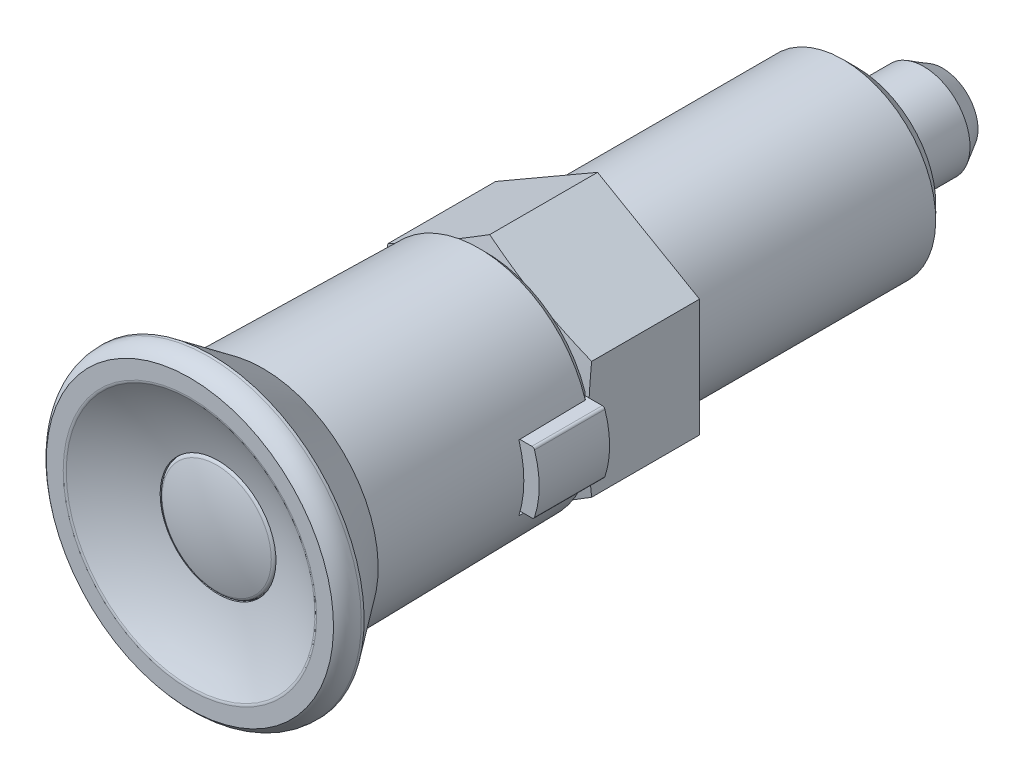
ISO-10303-21;
HEADER;
FILE_DESCRIPTION(('STEP AP214'),'2;1');
FILE_NAME('part.step','',(''),(''),'','','');
FILE_SCHEMA(('AUTOMOTIVE_DESIGN { 1 0 10303 214 1 1 1 1 }'));
ENDSEC;
DATA;
#1=APPLICATION_CONTEXT('core data for automotive mechanical design processes');
#2=APPLICATION_PROTOCOL_DEFINITION('international standard','automotive_design',2000,#1);
#3=PRODUCT_CONTEXT('',#1,'mechanical');
#4=PRODUCT('Part','Part','',(#3));
#5=PRODUCT_RELATED_PRODUCT_CATEGORY('part','',(#4));
#6=PRODUCT_DEFINITION_FORMATION('','',#4);
#7=PRODUCT_DEFINITION_CONTEXT('part definition',#1,'design');
#8=PRODUCT_DEFINITION('design','',#6,#7);
#9=PRODUCT_DEFINITION_SHAPE('','',#8);
#10=(LENGTH_UNIT() NAMED_UNIT(*) SI_UNIT(.MILLI.,.METRE.));
#11=(NAMED_UNIT(*) PLANE_ANGLE_UNIT() SI_UNIT($,.RADIAN.));
#12=(NAMED_UNIT(*) SI_UNIT($,.STERADIAN.) SOLID_ANGLE_UNIT());
#13=UNCERTAINTY_MEASURE_WITH_UNIT(LENGTH_MEASURE(1.E-05),#10,'distance_accuracy_value','');
#14=(GEOMETRIC_REPRESENTATION_CONTEXT(3) GLOBAL_UNCERTAINTY_ASSIGNED_CONTEXT((#13)) GLOBAL_UNIT_ASSIGNED_CONTEXT((#10,
#11,#12)) REPRESENTATION_CONTEXT('',''));
#15=CARTESIAN_POINT('',(0.,0.,0.));
#16=DIRECTION('',(0.,0.,1.));
#17=DIRECTION('',(1.,0.,0.));
#18=AXIS2_PLACEMENT_3D('',#15,#16,#17);
#19=CARTESIAN_POINT('',(9.3,-4.55,20.1));
#20=DIRECTION('',(0.,0.,1.));
#21=DIRECTION('',(0.,-1.,0.));
#22=AXIS2_PLACEMENT_3D('',#19,#20,#21);
#23=PLANE('',#22);
#24=DIRECTION('',(0.,-1.,0.));
#25=VECTOR('',#24,1.);
#26=CARTESIAN_POINT('',(9.8,4.55,20.1));
#27=LINE('',#26,#25);
#28=CARTESIAN_POINT('',(9.8,3.55,20.1));
#29=VERTEX_POINT('',#28);
#30=CARTESIAN_POINT('',(9.8,-3.55,20.1));
#31=VERTEX_POINT('',#30);
#32=EDGE_CURVE('E187',#29,#31,#27,.T.);
#33=ORIENTED_EDGE('',*,*,#32,.F.);
#34=DIRECTION('',(-1.,0.,0.));
#35=VECTOR('',#34,1.);
#36=CARTESIAN_POINT('',(16.5,3.55,20.1));
#37=LINE('',#36,#35);
#38=CARTESIAN_POINT('',(11.6108033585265,3.55,20.1));
#39=VERTEX_POINT('',#38);
#40=EDGE_CURVE('E179',#39,#29,#37,.T.);
#41=ORIENTED_EDGE('',*,*,#40,.F.);
#42=CARTESIAN_POINT('',(0.,0.,20.1));
#43=DIRECTION('',(0.,0.,1.));
#44=DIRECTION('',(0.,-1.,0.));
#45=AXIS2_PLACEMENT_3D('',#42,#43,#44);
#46=CIRCLE('',#45,12.1413860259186);
#47=CARTESIAN_POINT('',(11.6108033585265,-3.55,20.1));
#48=VERTEX_POINT('',#47);
#49=EDGE_CURVE('E171',#48,#39,#46,.T.);
#50=ORIENTED_EDGE('',*,*,#49,.F.);
#51=DIRECTION('',(1.,0.,0.));
#52=VECTOR('',#51,1.);
#53=CARTESIAN_POINT('',(9.8,-3.55,20.1));
#54=LINE('',#53,#52);
#55=EDGE_CURVE('E873',#31,#48,#54,.T.);
#56=ORIENTED_EDGE('',*,*,#55,.F.);
#57=EDGE_LOOP('',(#33,#41,#50,#56));
#58=FACE_BOUND('',#57,.T.);
#59=ADVANCED_FACE('F14',(#58),#23,.F.);
#60=CARTESIAN_POINT('',(0.,0.,12.));
#61=DIRECTION('',(0.,0.,-1.));
#62=DIRECTION('',(0.,1.,0.));
#63=AXIS2_PLACEMENT_3D('',#60,#61,#62);
#64=PLANE('',#63);
#65=DIRECTION('',(0.,1.,0.));
#66=VECTOR('',#65,1.);
#67=CARTESIAN_POINT('',(9.8,4.55,12.));
#68=LINE('',#67,#66);
#69=CARTESIAN_POINT('',(9.8,-3.55,12.));
#70=VERTEX_POINT('',#69);
#71=CARTESIAN_POINT('',(9.8,3.55,12.));
#72=VERTEX_POINT('',#71);
#73=EDGE_CURVE('E164',#70,#72,#68,.T.);
#74=ORIENTED_EDGE('',*,*,#73,.F.);
#75=DIRECTION('',(1.,0.,0.));
#76=VECTOR('',#75,1.);
#77=CARTESIAN_POINT('',(9.8,-3.55,12.));
#78=LINE('',#77,#76);
#79=CARTESIAN_POINT('',(10.4114120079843,-3.55,12.));
#80=VERTEX_POINT('',#79);
#81=EDGE_CURVE('E871',#70,#80,#78,.T.);
#82=ORIENTED_EDGE('',*,*,#81,.T.);
#83=CARTESIAN_POINT('',(0.,0.,12.));
#84=DIRECTION('',(0.,0.,-1.));
#85=DIRECTION('',(0.,1.,0.));
#86=AXIS2_PLACEMENT_3D('',#83,#84,#85);
#87=CIRCLE('',#86,11.);
#88=CARTESIAN_POINT('',(11.,0.,12.));
#89=VERTEX_POINT('',#88);
#90=EDGE_CURVE('E488',#89,#80,#87,.T.);
#91=ORIENTED_EDGE('',*,*,#90,.F.);
#92=CARTESIAN_POINT('',(10.4114120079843,3.55,12.));
#93=VERTEX_POINT('',#92);
#94=EDGE_CURVE('E168',#93,#89,#87,.T.);
#95=ORIENTED_EDGE('',*,*,#94,.F.);
#96=DIRECTION('',(1.,0.,0.));
#97=VECTOR('',#96,1.);
#98=CARTESIAN_POINT('',(11.2,3.55,12.));
#99=LINE('',#98,#97);
#100=EDGE_CURVE('E159',#72,#93,#99,.T.);
#101=ORIENTED_EDGE('',*,*,#100,.F.);
#102=EDGE_LOOP('',(#74,#82,#91,#95,#101));
#103=FACE_BOUND('',#102,.T.);
#104=ADVANCED_FACE('F161',(#103),#64,.F.);
#105=CARTESIAN_POINT('',(0.,0.,66.2));
#106=DIRECTION('',(0.,0.,-1.));
#107=DIRECTION('',(-1.,0.,0.));
#108=AXIS2_PLACEMENT_3D('',#105,#106,#107);
#109=SPHERICAL_SURFACE('',#108,26.);
#110=CARTESIAN_POINT('',(0.,0.,43.9283018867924));
#111=DIRECTION('',(0.,0.,-1.));
#112=DIRECTION('',(0.,1.,0.));
#113=AXIS2_PLACEMENT_3D('',#110,#111,#112);
#114=CIRCLE('',#113,13.4153443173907);
#115=CARTESIAN_POINT('',(-13.4153443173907,0.,43.9283018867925));
#116=VERTEX_POINT('',#115);
#117=EDGE_CURVE('E404',#116,#116,#114,.T.);
#118=CARTESIAN_POINT('',(0.,0.,40.9623792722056));
#119=DIRECTION('',(0.,0.,1.));
#120=DIRECTION('',(0.,-1.,0.));
#121=AXIS2_PLACEMENT_3D('',#118,#119,#120);
#122=CIRCLE('',#121,6.25);
#123=CARTESIAN_POINT('',(-6.24999999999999,0.,40.9623792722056));
#124=VERTEX_POINT('',#123);
#125=EDGE_CURVE('E243',#124,#124,#122,.T.);
#126=CARTESIAN_POINT('',(-13.4153443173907,0.,43.9283018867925));
#127=CARTESIAN_POINT('',(-13.3458883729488,0.,43.8864651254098));
#128=CARTESIAN_POINT('',(-13.2762367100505,0.,43.8449532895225));
#129=CARTESIAN_POINT('',(-13.1365480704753,0.,43.762583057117));
#130=CARTESIAN_POINT('',(-13.0665110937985,0.,43.7217246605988));
#131=CARTESIAN_POINT('',(-12.9260579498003,0.,43.6406648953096));
#132=CARTESIAN_POINT('',(-12.8556417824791,0.,43.6004635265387));
#133=CARTESIAN_POINT('',(-12.7144364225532,0.,43.5207213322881));
#134=CARTESIAN_POINT('',(-12.6436472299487,0.,43.4811805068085));
#135=CARTESIAN_POINT('',(-12.5017020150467,0.,43.4027628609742));
#136=CARTESIAN_POINT('',(-12.4305459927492,0.,43.3638860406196));
#137=CARTESIAN_POINT('',(-12.2878733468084,0.,43.2867998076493));
#138=CARTESIAN_POINT('',(-12.2163567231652,0.,43.2485903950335));
#139=CARTESIAN_POINT('',(-12.0729691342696,0.,43.1728423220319));
#140=CARTESIAN_POINT('',(-12.0010981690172,0.,43.1353036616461));
#141=CARTESIAN_POINT('',(-11.8570081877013,0.,43.0609003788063));
#142=CARTESIAN_POINT('',(-11.7847891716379,0.,43.0240357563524));
#143=CARTESIAN_POINT('',(-11.6400094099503,0.,42.9509837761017));
#144=CARTESIAN_POINT('',(-11.5674486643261,0.,42.9147964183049));
#145=CARTESIAN_POINT('',(-11.4219917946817,0.,42.8431021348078));
#146=CARTESIAN_POINT('',(-11.3490956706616,0.,42.8075952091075));
#147=CARTESIAN_POINT('',(-11.2029744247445,0.,42.7372648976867));
#148=CARTESIAN_POINT('',(-11.1297493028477,0.,42.7024415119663));
#149=CARTESIAN_POINT('',(-10.9829764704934,0.,42.6334813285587));
#150=CARTESIAN_POINT('',(-10.9094287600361,0.,42.5993445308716));
#151=CARTESIAN_POINT('',(-10.762017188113,0.,42.5317605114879));
#152=CARTESIAN_POINT('',(-10.6881533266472,0.,42.4983132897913));
#153=CARTESIAN_POINT('',(-10.5401159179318,0.,42.4321113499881));
#154=CARTESIAN_POINT('',(-10.4659423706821,0.,42.3993566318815));
#155=CARTESIAN_POINT('',(-10.3172920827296,0.,42.3345425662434));
#156=CARTESIAN_POINT('',(-10.2428153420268,0.,42.302483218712));
#157=CARTESIAN_POINT('',(-10.0935651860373,0.,42.2390627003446));
#158=CARTESIAN_POINT('',(-10.0187917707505,0.,42.2077015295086));
#159=CARTESIAN_POINT('',(-9.86895481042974,0.,42.1456801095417));
#160=CARTESIAN_POINT('',(-9.7938912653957,0.,42.1150198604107));
#161=CARTESIAN_POINT('',(-9.64348061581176,0.,42.0544029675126));
#162=CARTESIAN_POINT('',(-9.56813351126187,0.,42.0244463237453));
#163=CARTESIAN_POINT('',(-9.41716233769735,0.,41.9652392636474));
#164=CARTESIAN_POINT('',(-9.34153826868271,0.,41.9359888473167));
#165=CARTESIAN_POINT('',(-9.1900197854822,0.,41.8781968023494));
#166=CARTESIAN_POINT('',(-9.11412537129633,0.,41.8496551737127));
#167=CARTESIAN_POINT('',(-8.96207284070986,0.,41.7932832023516));
#168=CARTESIAN_POINT('',(-8.88591472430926,0.,41.7654528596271));
#169=CARTESIAN_POINT('',(-8.73334145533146,0.,41.7105058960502));
#170=CARTESIAN_POINT('',(-8.65692630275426,0.,41.6833892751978));
#171=CARTESIAN_POINT('',(-8.50384564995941,0.,41.6298721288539));
#172=CARTESIAN_POINT('',(-8.42718014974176,0.,41.6034716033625));
#173=CARTESIAN_POINT('',(-8.27360551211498,0.,41.5513889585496));
#174=CARTESIAN_POINT('',(-8.19669637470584,0.,41.5257068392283));
#175=CARTESIAN_POINT('',(-8.04264119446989,0.,41.4750632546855));
#176=CARTESIAN_POINT('',(-7.96549515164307,0.,41.450101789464));
#177=CARTESIAN_POINT('',(-7.81097291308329,0.,41.400901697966));
#178=CARTESIAN_POINT('',(-7.73359671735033,0.,41.3766630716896));
#179=CARTESIAN_POINT('',(-7.5786209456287,0.,41.3289107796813));
#180=CARTESIAN_POINT('',(-7.50102136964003,0.,41.3053971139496));
#181=CARTESIAN_POINT('',(-7.34560562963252,0.,41.2590968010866));
#182=CARTESIAN_POINT('',(-7.26778946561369,0.,41.2363101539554));
#183=CARTESIAN_POINT('',(-7.11194736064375,0.,41.1914658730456));
#184=CARTESIAN_POINT('',(-7.03392141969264,0.,41.1694082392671));
#185=CARTESIAN_POINT('',(-6.87766659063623,0.,41.1260239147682));
#186=CARTESIAN_POINT('',(-6.79943770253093,0.,41.1046972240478));
#187=CARTESIAN_POINT('',(-6.64278382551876,0.,41.0627766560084));
#188=CARTESIAN_POINT('',(-6.56435883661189,0.,41.0421827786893));
#189=CARTESIAN_POINT('',(-6.40731962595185,0.,41.0017296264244));
#190=CARTESIAN_POINT('',(-6.32870540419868,0.,40.9818703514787));
#191=CARTESIAN_POINT('',(-6.24999999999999,0.,40.9623792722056));
#192=B_SPLINE_CURVE_WITH_KNOTS('',3,(#126,#127,#128,#129,#130,#131,#132,#133,#134,#135,#136,
#137,#138,#139,#140,#141,#142,#143,#144,#145,#146,#147,#148,#149,#150,#151,#152,#153,#154,#155,
#156,#157,#158,#159,#160,#161,#162,#163,#164,#165,#166,#167,#168,#169,#170,#171,#172,#173,#174,
#175,#176,#177,#178,#179,#180,#181,#182,#183,#184,#185,#186,#187,#188,#189,#190,#191),
.UNSPECIFIED.,.F.,.F.,(4,2,2,2,2,2,2,2,2,2,2,2,2,2,2,2,2,2,2,2,2,2,2,2,2,2,2,2,2,2,2,2,4),(0.,
0.243247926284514,0.486495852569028,0.729743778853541,0.972991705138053,1.21623963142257,
1.45948755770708,1.7027354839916,1.94598341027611,2.18923133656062,2.43247926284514,
2.67572718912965,2.91897511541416,3.16222304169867,3.40547096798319,3.6487188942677,
3.89196682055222,4.13521474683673,4.37846267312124,4.62171059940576,4.86495852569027,
5.10820645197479,5.3514543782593,5.59470230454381,5.83795023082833,6.08119815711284,
6.32444608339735,6.56769400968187,6.81094193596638,7.05418986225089,7.29743778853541,
7.54068571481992,7.78393364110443),.UNSPECIFIED.);
#193=EDGE_CURVE('BSEAM16',#116,#124,#192,.T.);
#194=ORIENTED_EDGE('',*,*,#117,.F.);
#195=ORIENTED_EDGE('',*,*,#125,.F.);
#196=ORIENTED_EDGE('',*,*,#193,.T.);
#197=ORIENTED_EDGE('',*,*,#193,.F.);
#198=EDGE_LOOP('',(#194,#196,#195,#197));
#199=FACE_BOUND('',#198,.T.);
#200=ADVANCED_FACE('F16',(#199),#109,.F.);
#201=CARTESIAN_POINT('',(0.,0.,12.));
#202=DIRECTION('',(0.,0.,-1.));
#203=DIRECTION('',(0.,1.,0.));
#204=AXIS2_PLACEMENT_3D('',#201,#202,#203);
#205=CONICAL_SURFACE('',#204,11.,1.36135681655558);
#206=CARTESIAN_POINT('',(-11.,16.8178878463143,10.066627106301));
#207=CARTESIAN_POINT('',(-11.,16.3182818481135,10.1554764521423));
#208=CARTESIAN_POINT('',(-11.,15.8184756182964,10.2432197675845));
#209=CARTESIAN_POINT('',(-11.,14.818365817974,10.4159048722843));
#210=CARTESIAN_POINT('',(-11.,14.3180622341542,10.5008465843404));
#211=CARTESIAN_POINT('',(-11.,13.3165820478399,10.6673849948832));
#212=CARTESIAN_POINT('',(-11.,12.8154050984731,10.748979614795));
#213=CARTESIAN_POINT('',(-11.,11.8123873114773,10.907978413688));
#214=CARTESIAN_POINT('',(-11.,11.3105464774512,10.9853826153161));
#215=CARTESIAN_POINT('',(-11.,10.3085576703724,11.1346523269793));
#216=CARTESIAN_POINT('',(-11.,9.80841349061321,11.2065431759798));
#217=CARTESIAN_POINT('',(-11.,8.80725851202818,11.3440023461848));
#218=CARTESIAN_POINT('',(-11.,8.30624772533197,11.4095707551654));
#219=CARTESIAN_POINT('',(-11.,7.30330078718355,11.5329312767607));
#220=CARTESIAN_POINT('',(-11.,6.80136471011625,11.590723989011));
#221=CARTESIAN_POINT('',(-11.,5.79648381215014,11.6968623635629));
#222=CARTESIAN_POINT('',(-11.,5.29353899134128,11.7452080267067));
#223=CARTESIAN_POINT('',(-11.,4.28317402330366,11.8309480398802));
#224=CARTESIAN_POINT('',(-11.,3.77574710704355,11.8682637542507));
#225=CARTESIAN_POINT('',(-11.,2.76009003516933,11.9297395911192));
#226=CARTESIAN_POINT('',(-11.,2.2518598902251,11.9538998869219));
#227=CARTESIAN_POINT('',(-11.,1.23504899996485,11.9877286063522));
#228=CARTESIAN_POINT('',(-11.,0.726468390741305,11.9974010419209));
#229=CARTESIAN_POINT('',(-11.,-0.290757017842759,12.0016819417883));
#230=CARTESIAN_POINT('',(-11.,-0.799401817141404,11.9962904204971));
#231=CARTESIAN_POINT('',(-11.,-1.81747803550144,11.9707439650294));
#232=CARTESIAN_POINT('',(-11.,-2.32690859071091,11.9505552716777));
#233=CARTESIAN_POINT('',(-11.,-3.34503893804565,11.8965322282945));
#234=CARTESIAN_POINT('',(-11.,-3.85373872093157,11.8626977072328));
#235=CARTESIAN_POINT('',(-11.,-4.87038430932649,11.7830448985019));
#236=CARTESIAN_POINT('',(-11.,-5.37832974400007,11.7372219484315));
#237=CARTESIAN_POINT('',(-11.,-6.39319465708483,11.6354538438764));
#238=CARTESIAN_POINT('',(-11.,-6.90011413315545,11.5795086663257));
#239=CARTESIAN_POINT('',(-11.,-7.88646599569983,11.462413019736));
#240=CARTESIAN_POINT('',(-11.,-8.36594937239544,11.4016878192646));
#241=CARTESIAN_POINT('',(-11.,-9.32409830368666,11.2740664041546));
#242=CARTESIAN_POINT('',(-11.,-9.80276384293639,11.2071700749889));
#243=CARTESIAN_POINT('',(-11.,-10.7593917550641,11.0683251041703));
#244=CARTESIAN_POINT('',(-11.,-11.2373540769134,10.9963761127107));
#245=CARTESIAN_POINT('',(-11.,-12.1926337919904,10.8483508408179));
#246=CARTESIAN_POINT('',(-11.,-12.6699511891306,10.7722745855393));
#247=CARTESIAN_POINT('',(-11.,-13.6241286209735,10.6167240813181));
#248=CARTESIAN_POINT('',(-11.,-14.1009885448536,10.5372491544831));
#249=CARTESIAN_POINT('',(-11.,-15.0542354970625,10.3755080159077));
#250=CARTESIAN_POINT('',(-11.,-15.5306225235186,10.2932417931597));
#251=CARTESIAN_POINT('',(-11.,-16.9591363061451,10.0430071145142));
#252=CARTESIAN_POINT('',(-11.,-17.9106596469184,9.87159539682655));
#253=CARTESIAN_POINT('',(-11.,-19.8066175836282,9.52346221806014));
#254=CARTESIAN_POINT('',(-11.,-20.751059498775,9.3467803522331));
#255=CARTESIAN_POINT('',(-11.,-22.639087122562,8.98884435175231));
#256=CARTESIAN_POINT('',(-11.,-23.5826728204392,8.80759016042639));
#257=CARTESIAN_POINT('',(-11.,-25.4683613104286,8.44187765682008));
#258=CARTESIAN_POINT('',(-11.,-26.4104646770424,8.25742229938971));
#259=CARTESIAN_POINT('',(-11.,-28.294139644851,7.88592455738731));
#260=CARTESIAN_POINT('',(-11.,-29.2357112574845,7.69888223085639));
#261=CARTESIAN_POINT('',(-11.,-30.1770987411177,7.5109282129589));
#262=B_SPLINE_CURVE_WITH_KNOTS('',3,(#206,#207,#208,#209,#210,#211,#212,#213,#214,#215,#216,
#217,#218,#219,#220,#221,#222,#223,#224,#225,#226,#227,#228,#229,#230,#231,#232,#233,#234,#235,
#236,#237,#238,#239,#240,#241,#242,#243,#244,#245,#246,#247,#248,#249,#250,#251,#252,#253,#254,
#255,#256,#257,#258,#259,#260,#261),.UNSPECIFIED.,.F.,.F.,(4,2,2,2,2,2,2,2,2,2,2,2,2,2,2,2,2,2,
2,2,2,2,2,2,2,2,2,4),(0.,1.52233876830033,3.04471945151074,4.56803166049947,6.09133563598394,
7.60715698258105,9.12295728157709,10.6386406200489,12.1543238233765,13.6805656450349,
15.20678736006,16.7325863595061,18.2583838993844,19.7876733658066,21.3169820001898,
22.8468862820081,24.3767940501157,25.8266868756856,27.2766066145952,28.7266268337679,
30.1766382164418,31.6269401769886,33.0772478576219,35.9777297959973,38.8601952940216,
41.742696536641,44.622665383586,47.5025697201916),.UNSPECIFIED.);
#263=CARTESIAN_POINT('',(-11.,-6.35085296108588,11.6382912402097));
#264=VERTEX_POINT('',#263);
#265=CARTESIAN_POINT('',(-11.,0.,12.));
#266=VERTEX_POINT('',#265);
#267=EDGE_CURVE('E503',#264,#266,#262,.F.);
#268=ORIENTED_EDGE('',*,*,#267,.F.);
#269=CARTESIAN_POINT('',(0.000199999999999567,-12.7018213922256,11.6382666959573));
#270=CARTESIAN_POINT('',(-0.457182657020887,-12.4377513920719,11.6944203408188));
#271=CARTESIAN_POINT('',(-0.915090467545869,-12.1733781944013,11.7453526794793));
#272=CARTESIAN_POINT('',(-1.83192466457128,-11.6440437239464,11.8347813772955));
#273=CARTESIAN_POINT('',(-2.29085127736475,-11.3790823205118,11.873274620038));
#274=CARTESIAN_POINT('',(-3.20796596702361,-10.8495859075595,11.9356997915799));
#275=CARTESIAN_POINT('',(-3.66615157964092,-10.5850523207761,11.9596787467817));
#276=CARTESIAN_POINT('',(-4.58289149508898,-10.0557722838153,11.9918279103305));
#277=CARTESIAN_POINT('',(-5.04144574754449,-9.79102586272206,12.));
#278=CARTESIAN_POINT('',(-5.95855425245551,-9.26153302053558,12.));
#279=CARTESIAN_POINT('',(-6.41710850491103,-8.99678659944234,11.9918279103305));
#280=CARTESIAN_POINT('',(-7.33384842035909,-8.46750656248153,11.9596787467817));
#281=CARTESIAN_POINT('',(-7.79203403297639,-8.20297297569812,11.9356997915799));
#282=CARTESIAN_POINT('',(-8.70914872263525,-7.67347656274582,11.873274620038));
#283=CARTESIAN_POINT('',(-9.16807533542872,-7.40851515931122,11.8347813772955));
#284=CARTESIAN_POINT('',(-10.0849095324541,-6.87918068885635,11.7453526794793));
#285=CARTESIAN_POINT('',(-10.5428173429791,-6.61480749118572,11.6944203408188));
#286=CARTESIAN_POINT('',(-11.0002,-6.35073749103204,11.6382666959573));
#287=B_SPLINE_CURVE_WITH_KNOTS('',3,(#269,#270,#271,#272,#273,#274,#275,#276,#277,#278,#279,
#280,#281,#282,#283,#284,#285,#286),.UNSPECIFIED.,.F.,.F.,(4,2,2,2,2,2,2,2,4),(0.,
1.5934014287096,3.18720174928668,4.77581011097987,6.36422938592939,7.95264866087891,
9.5412570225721,11.1350573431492,12.7284587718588),.UNSPECIFIED.);
#288=CARTESIAN_POINT('',(-5.5,-9.52627944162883,12.));
#289=VERTEX_POINT('',#288);
#290=EDGE_CURVE('E264',#289,#264,#287,.T.);
#291=ORIENTED_EDGE('',*,*,#290,.F.);
#292=EDGE_CURVE('E484',#289,#266,#87,.T.);
#293=ORIENTED_EDGE('',*,*,#292,.T.);
#294=EDGE_LOOP('',(#268,#291,#293));
#295=FACE_BOUND('',#294,.T.);
#296=ADVANCED_FACE('F294',(#295),#205,.T.);
#297=CARTESIAN_POINT('',(-11.,6.35085296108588,11.6382912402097));
#298=VERTEX_POINT('',#297);
#299=EDGE_CURVE('E504',#266,#298,#262,.F.);
#300=ORIENTED_EDGE('',*,*,#299,.F.);
#301=CARTESIAN_POINT('',(-5.5,9.52627944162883,12.));
#302=VERTEX_POINT('',#301);
#303=EDGE_CURVE('E862',#266,#302,#87,.T.);
#304=ORIENTED_EDGE('',*,*,#303,.T.);
#305=CARTESIAN_POINT('',(-11.0002,6.35073749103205,11.6382666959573));
#306=CARTESIAN_POINT('',(-10.5428173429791,6.61480749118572,11.6944203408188));
#307=CARTESIAN_POINT('',(-10.0849095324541,6.87918068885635,11.7453526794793));
#308=CARTESIAN_POINT('',(-9.16807533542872,7.40851515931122,11.8347813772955));
#309=CARTESIAN_POINT('',(-8.70914872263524,7.67347656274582,11.873274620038));
#310=CARTESIAN_POINT('',(-7.79203403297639,8.20297297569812,11.9356997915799));
#311=CARTESIAN_POINT('',(-7.33384842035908,8.46750656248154,11.9596787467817));
#312=CARTESIAN_POINT('',(-6.41710850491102,8.99678659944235,11.9918279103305));
#313=CARTESIAN_POINT('',(-5.95855425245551,9.26153302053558,12.));
#314=CARTESIAN_POINT('',(-5.04144574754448,9.79102586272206,12.));
#315=CARTESIAN_POINT('',(-4.58289149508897,10.0557722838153,11.9918279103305));
#316=CARTESIAN_POINT('',(-3.66615157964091,10.5850523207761,11.9596787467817));
#317=CARTESIAN_POINT('',(-3.20796596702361,10.8495859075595,11.9356997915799));
#318=CARTESIAN_POINT('',(-2.29085127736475,11.3790823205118,11.873274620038));
#319=CARTESIAN_POINT('',(-1.83192466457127,11.6440437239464,11.8347813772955));
#320=CARTESIAN_POINT('',(-0.915090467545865,12.1733781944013,11.7453526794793));
#321=CARTESIAN_POINT('',(-0.457182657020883,12.4377513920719,11.6944203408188));
#322=CARTESIAN_POINT('',(0.000200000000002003,12.7018213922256,11.6382666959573));
#323=B_SPLINE_CURVE_WITH_KNOTS('',3,(#305,#306,#307,#308,#309,#310,#311,#312,#313,#314,#315,
#316,#317,#318,#319,#320,#321,#322),.UNSPECIFIED.,.F.,.F.,(4,2,2,2,2,2,2,2,4),(0.,
1.5934014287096,3.18720174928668,4.77581011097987,6.36422938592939,7.95264866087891,
9.5412570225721,11.1350573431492,12.7284587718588),.UNSPECIFIED.);
#324=EDGE_CURVE('E435',#298,#302,#323,.T.);
#325=ORIENTED_EDGE('',*,*,#324,.F.);
#326=EDGE_LOOP('',(#300,#304,#325));
#327=FACE_BOUND('',#326,.T.);
#328=ADVANCED_FACE('F715',(#327),#205,.T.);
#329=CARTESIAN_POINT('',(0.,12.7017059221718,11.6382912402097));
#330=VERTEX_POINT('',#329);
#331=EDGE_CURVE('E426',#302,#330,#323,.T.);
#332=ORIENTED_EDGE('',*,*,#331,.F.);
#333=CARTESIAN_POINT('',(5.5,9.52627944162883,12.));
#334=VERTEX_POINT('',#333);
#335=EDGE_CURVE('E433',#302,#334,#87,.T.);
#336=ORIENTED_EDGE('',*,*,#335,.T.);
#337=CARTESIAN_POINT('',(-0.0002,12.7018213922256,11.6382666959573));
#338=CARTESIAN_POINT('',(0.457182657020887,12.4377513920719,11.6944203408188));
#339=CARTESIAN_POINT('',(0.915090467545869,12.1733781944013,11.7453526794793));
#340=CARTESIAN_POINT('',(1.83192466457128,11.6440437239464,11.8347813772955));
#341=CARTESIAN_POINT('',(2.29085127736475,11.3790823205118,11.873274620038));
#342=CARTESIAN_POINT('',(3.20796596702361,10.8495859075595,11.9356997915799));
#343=CARTESIAN_POINT('',(3.66615157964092,10.5850523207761,11.9596787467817));
#344=CARTESIAN_POINT('',(4.58289149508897,10.0557722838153,11.9918279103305));
#345=CARTESIAN_POINT('',(5.04144574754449,9.79102586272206,12.));
#346=CARTESIAN_POINT('',(5.95855425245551,9.26153302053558,12.));
#347=CARTESIAN_POINT('',(6.41710850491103,8.99678659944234,11.9918279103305));
#348=CARTESIAN_POINT('',(7.33384842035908,8.46750656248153,11.9596787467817));
#349=CARTESIAN_POINT('',(7.79203403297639,8.20297297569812,11.9356997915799));
#350=CARTESIAN_POINT('',(8.70914872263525,7.67347656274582,11.873274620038));
#351=CARTESIAN_POINT('',(9.16807533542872,7.40851515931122,11.8347813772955));
#352=CARTESIAN_POINT('',(10.0849095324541,6.87918068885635,11.7453526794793));
#353=CARTESIAN_POINT('',(10.5428173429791,6.61480749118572,11.6944203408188));
#354=CARTESIAN_POINT('',(11.0002,6.35073749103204,11.6382666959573));
#355=B_SPLINE_CURVE_WITH_KNOTS('',3,(#337,#338,#339,#340,#341,#342,#343,#344,#345,#346,#347,
#348,#349,#350,#351,#352,#353,#354),.UNSPECIFIED.,.F.,.F.,(4,2,2,2,2,2,2,2,4),(0.,
1.5934014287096,3.18720174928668,4.77581011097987,6.36422938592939,7.95264866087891,
9.5412570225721,11.1350573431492,12.7284587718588),.UNSPECIFIED.);
#356=EDGE_CURVE('E428',#330,#334,#355,.T.);
#357=ORIENTED_EDGE('',*,*,#356,.F.);
#358=EDGE_LOOP('',(#332,#336,#357));
#359=FACE_BOUND('',#358,.T.);
#360=ADVANCED_FACE('F431',(#359),#205,.T.);
#361=CARTESIAN_POINT('',(11.,6.35085296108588,11.6382912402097));
#362=VERTEX_POINT('',#361);
#363=EDGE_CURVE('E419',#334,#362,#355,.T.);
#364=ORIENTED_EDGE('',*,*,#363,.F.);
#365=EDGE_CURVE('E490',#334,#93,#87,.T.);
#366=ORIENTED_EDGE('',*,*,#365,.T.);
#367=ORIENTED_EDGE('',*,*,#94,.T.);
#368=CARTESIAN_POINT('',(11.,16.8178878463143,10.066627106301));
#369=CARTESIAN_POINT('',(11.,16.3182818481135,10.1554764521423));
#370=CARTESIAN_POINT('',(11.,15.8184756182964,10.2432197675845));
#371=CARTESIAN_POINT('',(11.,14.818365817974,10.4159048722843));
#372=CARTESIAN_POINT('',(11.,14.3180622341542,10.5008465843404));
#373=CARTESIAN_POINT('',(11.,13.3165820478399,10.6673849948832));
#374=CARTESIAN_POINT('',(11.,12.8154050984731,10.748979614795));
#375=CARTESIAN_POINT('',(11.,11.8123873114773,10.907978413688));
#376=CARTESIAN_POINT('',(11.,11.3105464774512,10.9853826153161));
#377=CARTESIAN_POINT('',(11.,10.3085576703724,11.1346523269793));
#378=CARTESIAN_POINT('',(11.,9.8084134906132,11.2065431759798));
#379=CARTESIAN_POINT('',(11.,8.80725851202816,11.3440023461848));
#380=CARTESIAN_POINT('',(11.,8.30624772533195,11.4095707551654));
#381=CARTESIAN_POINT('',(11.,7.30330078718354,11.5329312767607));
#382=CARTESIAN_POINT('',(11.,6.80136471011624,11.5907239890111));
#383=CARTESIAN_POINT('',(11.,5.79648381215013,11.6968623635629));
#384=CARTESIAN_POINT('',(11.,5.29353899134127,11.7452080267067));
#385=CARTESIAN_POINT('',(11.,4.28317402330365,11.8309480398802));
#386=CARTESIAN_POINT('',(11.,3.77574710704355,11.8682637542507));
#387=CARTESIAN_POINT('',(11.,2.76009003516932,11.9297395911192));
#388=CARTESIAN_POINT('',(11.,2.2518598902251,11.9538998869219));
#389=CARTESIAN_POINT('',(11.,1.23504899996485,11.9877286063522));
#390=CARTESIAN_POINT('',(11.,0.726468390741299,11.9974010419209));
#391=CARTESIAN_POINT('',(11.,-0.290757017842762,12.0016819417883));
#392=CARTESIAN_POINT('',(11.,-0.799401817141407,11.9962904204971));
#393=CARTESIAN_POINT('',(11.,-1.81747803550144,11.9707439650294));
#394=CARTESIAN_POINT('',(11.,-2.32690859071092,11.9505552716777));
#395=CARTESIAN_POINT('',(11.,-3.34503893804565,11.8965322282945));
#396=CARTESIAN_POINT('',(11.,-3.85373872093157,11.8626977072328));
#397=CARTESIAN_POINT('',(11.,-4.87038430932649,11.7830448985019));
#398=CARTESIAN_POINT('',(11.,-5.37832974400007,11.7372219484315));
#399=CARTESIAN_POINT('',(11.,-6.39319465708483,11.6354538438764));
#400=CARTESIAN_POINT('',(11.,-6.90011413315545,11.5795086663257));
#401=CARTESIAN_POINT('',(11.,-7.88646599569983,11.462413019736));
#402=CARTESIAN_POINT('',(11.,-8.36594937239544,11.4016878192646));
#403=CARTESIAN_POINT('',(11.,-9.32409830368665,11.2740664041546));
#404=CARTESIAN_POINT('',(11.,-9.80276384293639,11.2071700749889));
#405=CARTESIAN_POINT('',(11.,-10.7593917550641,11.0683251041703));
#406=CARTESIAN_POINT('',(11.,-11.2373540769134,10.9963761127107));
#407=CARTESIAN_POINT('',(11.,-12.1926337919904,10.8483508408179));
#408=CARTESIAN_POINT('',(11.,-12.6699511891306,10.7722745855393));
#409=CARTESIAN_POINT('',(11.,-13.6241286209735,10.6167240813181));
#410=CARTESIAN_POINT('',(11.,-14.1009885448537,10.5372491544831));
#411=CARTESIAN_POINT('',(11.,-15.0542354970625,10.3755080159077));
#412=CARTESIAN_POINT('',(11.,-15.5306225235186,10.2932417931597));
#413=CARTESIAN_POINT('',(11.,-16.9591363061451,10.0430071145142));
#414=CARTESIAN_POINT('',(11.,-17.9106596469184,9.87159539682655));
#415=CARTESIAN_POINT('',(11.,-19.8066175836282,9.52346221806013));
#416=CARTESIAN_POINT('',(11.,-20.7510594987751,9.3467803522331));
#417=CARTESIAN_POINT('',(11.,-22.639087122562,8.98884435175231));
#418=CARTESIAN_POINT('',(11.,-23.5826728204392,8.80759016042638));
#419=CARTESIAN_POINT('',(11.,-25.4683613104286,8.44187765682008));
#420=CARTESIAN_POINT('',(11.,-26.4104646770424,8.2574222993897));
#421=CARTESIAN_POINT('',(11.,-28.294139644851,7.88592455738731));
#422=CARTESIAN_POINT('',(11.,-29.2357112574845,7.69888223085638));
#423=CARTESIAN_POINT('',(11.,-30.1770987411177,7.5109282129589));
#424=B_SPLINE_CURVE_WITH_KNOTS('',3,(#368,#369,#370,#371,#372,#373,#374,#375,#376,#377,#378,
#379,#380,#381,#382,#383,#384,#385,#386,#387,#388,#389,#390,#391,#392,#393,#394,#395,#396,#397,
#398,#399,#400,#401,#402,#403,#404,#405,#406,#407,#408,#409,#410,#411,#412,#413,#414,#415,#416,
#417,#418,#419,#420,#421,#422,#423),.UNSPECIFIED.,.F.,.F.,(4,2,2,2,2,2,2,2,2,2,2,2,2,2,2,2,2,2,
2,2,2,2,2,2,2,2,2,4),(0.,1.52233876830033,3.04471945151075,4.56803166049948,6.09133563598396,
7.60715698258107,9.1229572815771,10.6386406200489,12.1543238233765,13.6805656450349,
15.20678736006,16.7325863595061,18.2583838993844,19.7876733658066,21.3169820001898,
22.8468862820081,24.3767940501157,25.8266868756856,27.2766066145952,28.7266268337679,
30.1766382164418,31.6269401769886,33.0772478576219,35.9777297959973,38.8601952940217,
41.742696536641,44.622665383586,47.5025697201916),.UNSPECIFIED.);
#425=EDGE_CURVE('E437',#362,#89,#424,.T.);
#426=ORIENTED_EDGE('',*,*,#425,.F.);
#427=EDGE_LOOP('',(#364,#366,#367,#426));
#428=FACE_BOUND('',#427,.T.);
#429=ADVANCED_FACE('F702',(#428),#205,.T.);
#430=CARTESIAN_POINT('',(11.,-6.35085296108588,11.6382912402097));
#431=VERTEX_POINT('',#430);
#432=EDGE_CURVE('E443',#89,#431,#424,.T.);
#433=ORIENTED_EDGE('',*,*,#432,.F.);
#434=ORIENTED_EDGE('',*,*,#90,.T.);
#435=CARTESIAN_POINT('',(5.5,-9.52627944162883,12.));
#436=VERTEX_POINT('',#435);
#437=EDGE_CURVE('E480',#80,#436,#87,.T.);
#438=ORIENTED_EDGE('',*,*,#437,.T.);
#439=CARTESIAN_POINT('',(11.0002,-6.35073749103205,11.6382666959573));
#440=CARTESIAN_POINT('',(10.5428173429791,-6.61480749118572,11.6944203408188));
#441=CARTESIAN_POINT('',(10.0849095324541,-6.87918068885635,11.7453526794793));
#442=CARTESIAN_POINT('',(9.16807533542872,-7.40851515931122,11.8347813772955));
#443=CARTESIAN_POINT('',(8.70914872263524,-7.67347656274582,11.873274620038));
#444=CARTESIAN_POINT('',(7.79203403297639,-8.20297297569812,11.9356997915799));
#445=CARTESIAN_POINT('',(7.33384842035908,-8.46750656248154,11.9596787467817));
#446=CARTESIAN_POINT('',(6.41710850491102,-8.99678659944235,11.9918279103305));
#447=CARTESIAN_POINT('',(5.95855425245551,-9.26153302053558,12.));
#448=CARTESIAN_POINT('',(5.04144574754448,-9.79102586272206,12.));
#449=CARTESIAN_POINT('',(4.58289149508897,-10.0557722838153,11.9918279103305));
#450=CARTESIAN_POINT('',(3.66615157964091,-10.5850523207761,11.9596787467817));
#451=CARTESIAN_POINT('',(3.20796596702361,-10.8495859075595,11.9356997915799));
#452=CARTESIAN_POINT('',(2.29085127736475,-11.3790823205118,11.873274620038));
#453=CARTESIAN_POINT('',(1.83192466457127,-11.6440437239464,11.8347813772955));
#454=CARTESIAN_POINT('',(0.915090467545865,-12.1733781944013,11.7453526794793));
#455=CARTESIAN_POINT('',(0.457182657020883,-12.4377513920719,11.6944203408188));
#456=CARTESIAN_POINT('',(-0.000200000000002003,-12.7018213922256,11.6382666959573));
#457=B_SPLINE_CURVE_WITH_KNOTS('',3,(#439,#440,#441,#442,#443,#444,#445,#446,#447,#448,#449,
#450,#451,#452,#453,#454,#455,#456),.UNSPECIFIED.,.F.,.F.,(4,2,2,2,2,2,2,2,4),(0.,
1.5934014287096,3.18720174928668,4.77581011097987,6.36422938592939,7.95264866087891,
9.5412570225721,11.1350573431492,12.7284587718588),.UNSPECIFIED.);
#458=EDGE_CURVE('E467',#431,#436,#457,.T.);
#459=ORIENTED_EDGE('',*,*,#458,.F.);
#460=EDGE_LOOP('',(#433,#434,#438,#459));
#461=FACE_BOUND('',#460,.T.);
#462=ADVANCED_FACE('F487',(#461),#205,.T.);
#463=CARTESIAN_POINT('',(0.,-12.7017059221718,11.6382912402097));
#464=VERTEX_POINT('',#463);
#465=EDGE_CURVE('E287',#436,#464,#457,.T.);
#466=ORIENTED_EDGE('',*,*,#465,.F.);
#467=EDGE_CURVE('E476',#436,#289,#87,.T.);
#468=ORIENTED_EDGE('',*,*,#467,.T.);
#469=EDGE_CURVE('E286',#464,#289,#287,.T.);
#470=ORIENTED_EDGE('',*,*,#469,.F.);
#471=EDGE_LOOP('',(#466,#468,#470));
#472=FACE_BOUND('',#471,.T.);
#473=ADVANCED_FACE('F372',(#472),#205,.T.);
#474=CARTESIAN_POINT('',(0.,0.,36.1));
#475=DIRECTION('',(0.,0.,1.));
#476=DIRECTION('',(0.,-1.,0.));
#477=AXIS2_PLACEMENT_3D('',#474,#475,#476);
#478=CONICAL_SURFACE('',#477,12.42066706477,0.0174532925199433);
#479=CARTESIAN_POINT('',(11.7734384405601,-3.55,29.015453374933));
#480=CARTESIAN_POINT('',(11.6804021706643,-3.55,23.9120879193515));
#481=CARTESIAN_POINT('',(11.5872670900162,-3.55,18.8087242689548));
#482=CARTESIAN_POINT('',(11.4007993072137,-3.55,8.60200057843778));
#483=CARTESIAN_POINT('',(11.3074666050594,-3.55,3.49864053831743));
#484=CARTESIAN_POINT('',(11.2140350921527,-3.55,-1.60471769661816));
#485=B_SPLINE_CURVE_WITH_KNOTS('',3,(#479,#480,#481,#482,#483,#484),.UNSPECIFIED.,.F.,.F.,(4,2,
4),(0.,15.3126402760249,30.6252805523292),.UNSPECIFIED.);
#486=CARTESIAN_POINT('',(11.477490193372,-3.55,12.7998781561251));
#487=VERTEX_POINT('',#486);
#488=EDGE_CURVE('E378',#48,#487,#485,.T.);
#489=ORIENTED_EDGE('',*,*,#488,.F.);
#490=ORIENTED_EDGE('',*,*,#49,.T.);
#491=CARTESIAN_POINT('',(11.2140350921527,3.55,-1.60471769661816));
#492=CARTESIAN_POINT('',(11.3074666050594,3.55,3.49864053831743));
#493=CARTESIAN_POINT('',(11.4007993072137,3.55,8.60200057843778));
#494=CARTESIAN_POINT('',(11.5872670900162,3.55,18.8087242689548));
#495=CARTESIAN_POINT('',(11.6804021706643,3.55,23.9120879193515));
#496=CARTESIAN_POINT('',(11.7734384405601,3.55,29.015453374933));
#497=B_SPLINE_CURVE_WITH_KNOTS('',3,(#491,#492,#493,#494,#495,#496),.UNSPECIFIED.,.F.,.F.,(4,2,
4),(0.,15.3126402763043,30.6252805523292),.UNSPECIFIED.);
#498=CARTESIAN_POINT('',(11.477490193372,3.55,12.7998781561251));
#499=VERTEX_POINT('',#498);
#500=EDGE_CURVE('E354',#499,#39,#497,.T.);
#501=ORIENTED_EDGE('',*,*,#500,.F.);
#502=CARTESIAN_POINT('',(0.,0.,12.7998781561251));
#503=DIRECTION('',(0.,0.,-1.));
#504=DIRECTION('',(0.,1.,0.));
#505=AXIS2_PLACEMENT_3D('',#502,#503,#504);
#506=CIRCLE('',#505,12.0139619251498);
#507=EDGE_CURVE('E386',#487,#499,#506,.T.);
#508=ORIENTED_EDGE('',*,*,#507,.F.);
#509=EDGE_LOOP('',(#489,#490,#501,#508));
#510=FACE_BOUND('',#509,.T.);
#511=CARTESIAN_POINT('',(0.,0.,36.1));
#512=DIRECTION('',(0.,0.,-1.));
#513=DIRECTION('',(0.,1.,0.));
#514=AXIS2_PLACEMENT_3D('',#511,#512,#513);
#515=CIRCLE('',#514,12.42066706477);
#516=CARTESIAN_POINT('',(0.,12.42066706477,36.1));
#517=VERTEX_POINT('',#516);
#518=EDGE_CURVE('E389',#517,#517,#515,.T.);
#519=ORIENTED_EDGE('',*,*,#518,.T.);
#520=EDGE_LOOP('',(#519));
#521=FACE_BOUND('',#520,.T.);
#522=ADVANCED_FACE('F367',(#510,#521),#478,.T.);
#523=CARTESIAN_POINT('',(0.,0.,12.7998781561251));
#524=DIRECTION('',(0.,0.,1.));
#525=DIRECTION('',(0.,-1.,0.));
#526=AXIS2_PLACEMENT_3D('',#523,#524,#525);
#527=CONICAL_SURFACE('',#526,12.0139619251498,0.79412480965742);
#528=CARTESIAN_POINT('',(14.2074365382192,-3.55,15.384644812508));
#529=CARTESIAN_POINT('',(13.9268449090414,-3.55,15.1171360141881));
#530=CARTESIAN_POINT('',(13.6460251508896,-3.55,14.849866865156));
#531=CARTESIAN_POINT('',(13.0838291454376,-3.55,14.3159143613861));
#532=CARTESIAN_POINT('',(12.8024528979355,-3.55,14.0492310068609));
#533=CARTESIAN_POINT('',(11.9573796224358,-3.55,13.2502577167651));
#534=CARTESIAN_POINT('',(11.3926980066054,-3.55,12.7190063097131));
#535=CARTESIAN_POINT('',(10.5426831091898,-3.55,11.9252976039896));
#536=CARTESIAN_POINT('',(10.2588370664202,-3.55,11.6612478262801));
#537=CARTESIAN_POINT('',(9.68988890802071,-3.55,11.1345081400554));
#538=CARTESIAN_POINT('',(9.40478680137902,-3.55,10.8718182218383));
#539=CARTESIAN_POINT('',(8.83296060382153,-3.55,10.3481661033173));
#540=CARTESIAN_POINT('',(8.54623639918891,-3.55,10.0872040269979));
#541=CARTESIAN_POINT('',(8.1145773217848,-3.55,9.69749580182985));
#542=CARTESIAN_POINT('',(7.9704270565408,-3.55,9.56788062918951));
#543=CARTESIAN_POINT('',(7.68151712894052,-3.55,9.30932962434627));
#544=CARTESIAN_POINT('',(7.53675746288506,-3.55,9.18039379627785));
#545=CARTESIAN_POINT('',(7.39165082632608,-3.55,9.05184840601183));
#546=B_SPLINE_CURVE_WITH_KNOTS('',3,(#528,#529,#530,#531,#532,#533,#534,#535,#536,#537,#538,
#539,#540,#541,#542,#543,#544,#545),.UNSPECIFIED.,.F.,.F.,(4,2,2,2,2,2,2,2,4),(0.,
1.16302695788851,2.32605433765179,4.65194295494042,5.81496061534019,6.97796996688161,
8.14106188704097,8.72262211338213,9.30418587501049),.UNSPECIFIED.);
#547=CARTESIAN_POINT('',(10.6224997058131,-3.55,12.));
#548=VERTEX_POINT('',#547);
#549=EDGE_CURVE('E361',#487,#548,#546,.T.);
#550=ORIENTED_EDGE('',*,*,#549,.F.);
#551=ORIENTED_EDGE('',*,*,#507,.T.);
#552=CARTESIAN_POINT('',(7.39165082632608,3.55,9.05184840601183));
#553=CARTESIAN_POINT('',(7.53675746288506,3.55,9.18039379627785));
#554=CARTESIAN_POINT('',(7.68151712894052,3.55,9.30932962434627));
#555=CARTESIAN_POINT('',(7.9704270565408,3.55,9.5678806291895));
#556=CARTESIAN_POINT('',(8.11457732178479,3.55,9.69749580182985));
#557=CARTESIAN_POINT('',(8.54623639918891,3.55,10.0872040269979));
#558=CARTESIAN_POINT('',(8.83296060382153,3.55,10.3481661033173));
#559=CARTESIAN_POINT('',(9.40478680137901,3.55,10.8718182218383));
#560=CARTESIAN_POINT('',(9.68988890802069,3.55,11.1345081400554));
#561=CARTESIAN_POINT('',(10.2588370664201,3.55,11.6612478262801));
#562=CARTESIAN_POINT('',(10.5426831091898,3.55,11.9252976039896));
#563=CARTESIAN_POINT('',(11.3926980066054,3.55,12.7190063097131));
#564=CARTESIAN_POINT('',(11.9573796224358,3.55,13.2502577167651));
#565=CARTESIAN_POINT('',(12.8024528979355,3.55,14.0492310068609));
#566=CARTESIAN_POINT('',(13.0838291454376,3.55,14.3159143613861));
#567=CARTESIAN_POINT('',(13.6460251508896,3.55,14.849866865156));
#568=CARTESIAN_POINT('',(13.9268449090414,3.55,15.1171360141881));
#569=CARTESIAN_POINT('',(14.2074365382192,3.55,15.384644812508));
#570=B_SPLINE_CURVE_WITH_KNOTS('',3,(#552,#553,#554,#555,#556,#557,#558,#559,#560,#561,#562,
#563,#564,#565,#566,#567,#568,#569),.UNSPECIFIED.,.F.,.F.,(4,2,2,2,2,2,2,2,4),(0.,
0.581563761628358,1.16312398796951,2.32621590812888,3.48922525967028,4.65224292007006,
6.97813153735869,8.14115891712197,9.30418587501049),.UNSPECIFIED.);
#571=CARTESIAN_POINT('',(10.6224997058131,3.55,12.));
#572=VERTEX_POINT('',#571);
#573=EDGE_CURVE('E346',#572,#499,#570,.T.);
#574=ORIENTED_EDGE('',*,*,#573,.F.);
#575=CARTESIAN_POINT('',(0.,0.,12.));
#576=DIRECTION('',(0.,0.,-1.));
#577=DIRECTION('',(0.,1.,0.));
#578=AXIS2_PLACEMENT_3D('',#575,#576,#577);
#579=CIRCLE('',#578,11.2);
#580=EDGE_CURVE('E384',#548,#572,#579,.T.);
#581=ORIENTED_EDGE('',*,*,#580,.F.);
#582=EDGE_LOOP('',(#550,#551,#574,#581));
#583=FACE_BOUND('',#582,.T.);
#584=ADVANCED_FACE('F371',(#583),#527,.T.);
#585=CARTESIAN_POINT('',(11.2,0.,12.));
#586=DIRECTION('',(0.,0.,1.));
#587=DIRECTION('',(0.,-1.,0.));
#588=AXIS2_PLACEMENT_3D('',#585,#586,#587);
#589=PLANE('',#588);
#590=ORIENTED_EDGE('',*,*,#580,.T.);
#591=EDGE_CURVE('E172',#93,#572,#99,.T.);
#592=ORIENTED_EDGE('',*,*,#591,.F.);
#593=ORIENTED_EDGE('',*,*,#365,.F.);
#594=ORIENTED_EDGE('',*,*,#335,.F.);
#595=ORIENTED_EDGE('',*,*,#303,.F.);
#596=ORIENTED_EDGE('',*,*,#292,.F.);
#597=ORIENTED_EDGE('',*,*,#467,.F.);
#598=ORIENTED_EDGE('',*,*,#437,.F.);
#599=EDGE_CURVE('E489',#80,#548,#78,.T.);
#600=ORIENTED_EDGE('',*,*,#599,.T.);
#601=EDGE_LOOP('',(#590,#592,#593,#594,#595,#596,#597,#598,#600));
#602=FACE_BOUND('',#601,.T.);
#603=ADVANCED_FACE('F479',(#602),#589,.F.);
#604=CARTESIAN_POINT('',(0.,0.,43.5));
#605=DIRECTION('',(0.,0.,-1.));
#606=DIRECTION('',(0.,1.,0.));
#607=AXIS2_PLACEMENT_3D('',#604,#605,#606);
#608=TOROIDAL_SURFACE('',#607,13.6733317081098,0.500000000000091);
#609=ORIENTED_EDGE('',*,*,#117,.T.);
#610=EDGE_LOOP('',(#609));
#611=FACE_BOUND('',#610,.T.);
#612=CARTESIAN_POINT('',(0.,0.,44.));
#613=DIRECTION('',(0.,0.,-1.));
#614=DIRECTION('',(0.,1.,0.));
#615=AXIS2_PLACEMENT_3D('',#612,#613,#614);
#616=CIRCLE('',#615,13.6733317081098);
#617=CARTESIAN_POINT('',(0.,13.6733317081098,44.));
#618=VERTEX_POINT('',#617);
#619=EDGE_CURVE('E401',#618,#618,#616,.T.);
#620=ORIENTED_EDGE('',*,*,#619,.F.);
#621=EDGE_LOOP('',(#620));
#622=FACE_BOUND('',#621,.T.);
#623=ADVANCED_FACE('F666',(#611,#622),#608,.T.);
#624=CARTESIAN_POINT('',(13.6733317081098,0.,44.));
#625=DIRECTION('',(0.,0.,-1.));
#626=DIRECTION('',(0.,1.,0.));
#627=AXIS2_PLACEMENT_3D('',#624,#625,#626);
#628=PLANE('',#627);
#629=CARTESIAN_POINT('',(0.,0.,44.));
#630=DIRECTION('',(0.,0.,-1.));
#631=DIRECTION('',(0.,1.,0.));
#632=AXIS2_PLACEMENT_3D('',#629,#630,#631);
#633=CIRCLE('',#632,15.5);
#634=CARTESIAN_POINT('',(0.,15.5,44.));
#635=VERTEX_POINT('',#634);
#636=EDGE_CURVE('E398',#635,#635,#633,.T.);
#637=ORIENTED_EDGE('',*,*,#636,.F.);
#638=EDGE_LOOP('',(#637));
#639=FACE_BOUND('',#638,.T.);
#640=ORIENTED_EDGE('',*,*,#619,.T.);
#641=EDGE_LOOP('',(#640));
#642=FACE_BOUND('',#641,.T.);
#643=ADVANCED_FACE('F657',(#639,#642),#628,.F.);
#644=CARTESIAN_POINT('',(0.,0.,42.));
#645=DIRECTION('',(0.,0.,-1.));
#646=DIRECTION('',(0.,1.,0.));
#647=AXIS2_PLACEMENT_3D('',#644,#645,#646);
#648=TOROIDAL_SURFACE('',#647,14.,2.5);
#649=ORIENTED_EDGE('',*,*,#636,.T.);
#650=EDGE_LOOP('',(#649));
#651=FACE_BOUND('',#650,.T.);
#652=CARTESIAN_POINT('',(0.,0.,42.));
#653=DIRECTION('',(0.,0.,-1.));
#654=DIRECTION('',(0.,1.,0.));
#655=AXIS2_PLACEMENT_3D('',#652,#653,#654);
#656=CIRCLE('',#655,16.5);
#657=CARTESIAN_POINT('',(0.,16.5,42.));
#658=VERTEX_POINT('',#657);
#659=EDGE_CURVE('E395',#658,#658,#656,.T.);
#660=ORIENTED_EDGE('',*,*,#659,.F.);
#661=EDGE_LOOP('',(#660));
#662=FACE_BOUND('',#661,.T.);
#663=ADVANCED_FACE('F649',(#651,#662),#648,.T.);
#664=CARTESIAN_POINT('',(0.,0.,12.));
#665=DIRECTION('',(0.,0.,-1.));
#666=DIRECTION('',(0.,1.,0.));
#667=AXIS2_PLACEMENT_3D('',#664,#665,#666);
#668=CYLINDRICAL_SURFACE('',#667,16.5);
#669=CARTESIAN_POINT('',(0.,0.,41.6941617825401));
#670=DIRECTION('',(0.,0.,-1.));
#671=DIRECTION('',(0.,1.,0.));
#672=AXIS2_PLACEMENT_3D('',#669,#670,#671);
#673=CIRCLE('',#672,16.5);
#674=CARTESIAN_POINT('',(0.,16.5,41.6941617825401));
#675=VERTEX_POINT('',#674);
#676=EDGE_CURVE('E392',#675,#675,#673,.T.);
#677=ORIENTED_EDGE('',*,*,#676,.F.);
#678=EDGE_LOOP('',(#677));
#679=FACE_BOUND('',#678,.T.);
#680=ORIENTED_EDGE('',*,*,#659,.T.);
#681=EDGE_LOOP('',(#680));
#682=FACE_BOUND('',#681,.T.);
#683=ADVANCED_FACE('F641',(#679,#682),#668,.T.);
#684=CARTESIAN_POINT('',(0.,0.,41.6941617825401));
#685=DIRECTION('',(0.,0.,1.));
#686=DIRECTION('',(0.,-1.,0.));
#687=AXIS2_PLACEMENT_3D('',#684,#685,#686);
#688=CONICAL_SURFACE('',#687,16.5,0.630063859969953);
#689=ORIENTED_EDGE('',*,*,#518,.F.);
#690=EDGE_LOOP('',(#689));
#691=FACE_BOUND('',#690,.T.);
#692=ORIENTED_EDGE('',*,*,#676,.T.);
#693=EDGE_LOOP('',(#692));
#694=FACE_BOUND('',#693,.T.);
#695=ADVANCED_FACE('F375',(#691,#694),#688,.T.);
#696=CARTESIAN_POINT('',(9.8,-3.55,20.1));
#697=DIRECTION('',(0.,1.,0.));
#698=DIRECTION('',(-1.,0.,0.));
#699=AXIS2_PLACEMENT_3D('',#696,#697,#698);
#700=PLANE('',#699);
#701=ORIENTED_EDGE('',*,*,#488,.T.);
#702=ORIENTED_EDGE('',*,*,#549,.T.);
#703=ORIENTED_EDGE('',*,*,#599,.F.);
#704=ORIENTED_EDGE('',*,*,#81,.F.);
#705=DIRECTION('',(0.,0.,-1.));
#706=VECTOR('',#705,1.);
#707=CARTESIAN_POINT('',(9.8,-3.55,20.1));
#708=LINE('',#707,#706);
#709=EDGE_CURVE('E182',#31,#70,#708,.T.);
#710=ORIENTED_EDGE('',*,*,#709,.F.);
#711=ORIENTED_EDGE('',*,*,#55,.T.);
#712=EDGE_LOOP('',(#701,#702,#703,#704,#710,#711));
#713=FACE_BOUND('',#712,.T.);
#714=ADVANCED_FACE('F341',(#713),#700,.T.);
#715=CARTESIAN_POINT('',(16.5,3.55,20.1));
#716=DIRECTION('',(0.,-1.,0.));
#717=DIRECTION('',(1.,0.,0.));
#718=AXIS2_PLACEMENT_3D('',#715,#716,#717);
#719=PLANE('',#718);
#720=ORIENTED_EDGE('',*,*,#500,.T.);
#721=ORIENTED_EDGE('',*,*,#40,.T.);
#722=DIRECTION('',(0.,0.,-1.));
#723=VECTOR('',#722,1.);
#724=CARTESIAN_POINT('',(9.8,3.55,20.1));
#725=LINE('',#724,#723);
#726=EDGE_CURVE('E176',#29,#72,#725,.T.);
#727=ORIENTED_EDGE('',*,*,#726,.T.);
#728=ORIENTED_EDGE('',*,*,#100,.T.);
#729=ORIENTED_EDGE('',*,*,#591,.T.);
#730=ORIENTED_EDGE('',*,*,#573,.T.);
#731=EDGE_LOOP('',(#720,#721,#727,#728,#729,#730));
#732=FACE_BOUND('',#731,.T.);
#733=ADVANCED_FACE('F177',(#732),#719,.T.);
#734=CARTESIAN_POINT('',(-11.,6.35085296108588,0.));
#735=DIRECTION('',(-1.,0.,0.));
#736=DIRECTION('',(0.,-1.,0.));
#737=AXIS2_PLACEMENT_3D('',#734,#735,#736);
#738=PLANE('',#737);
#739=ORIENTED_EDGE('',*,*,#267,.T.);
#740=ORIENTED_EDGE('',*,*,#299,.T.);
#741=DIRECTION('',(0.,0.,1.));
#742=VECTOR('',#741,1.);
#743=CARTESIAN_POINT('',(-11.,6.35085296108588,0.));
#744=LINE('',#743,#742);
#745=CARTESIAN_POINT('',(-11.,6.35085296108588,0.));
#746=VERTEX_POINT('',#745);
#747=EDGE_CURVE('E261',#746,#298,#744,.T.);
#748=ORIENTED_EDGE('',*,*,#747,.F.);
#749=DIRECTION('',(0.,-1.,0.));
#750=VECTOR('',#749,1.);
#751=CARTESIAN_POINT('',(-11.,6.35085296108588,0.));
#752=LINE('',#751,#750);
#753=CARTESIAN_POINT('',(-11.,-6.35085296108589,0.));
#754=VERTEX_POINT('',#753);
#755=EDGE_CURVE('E258',#746,#754,#752,.T.);
#756=ORIENTED_EDGE('',*,*,#755,.T.);
#757=DIRECTION('',(0.,0.,1.));
#758=VECTOR('',#757,1.);
#759=CARTESIAN_POINT('',(-11.,-6.35085296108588,0.));
#760=LINE('',#759,#758);
#761=EDGE_CURVE('E260',#754,#264,#760,.T.);
#762=ORIENTED_EDGE('',*,*,#761,.T.);
#763=EDGE_LOOP('',(#739,#740,#748,#756,#762));
#764=FACE_BOUND('',#763,.T.);
#765=ADVANCED_FACE('F340',(#764),#738,.T.);
#766=CARTESIAN_POINT('',(0.,12.7017059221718,0.));
#767=DIRECTION('',(-0.5,0.866025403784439,0.));
#768=DIRECTION('',(-0.866025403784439,-0.5,0.));
#769=AXIS2_PLACEMENT_3D('',#766,#767,#768);
#770=PLANE('',#769);
#771=ORIENTED_EDGE('',*,*,#324,.T.);
#772=ORIENTED_EDGE('',*,*,#331,.T.);
#773=DIRECTION('',(0.,0.,1.));
#774=VECTOR('',#773,1.);
#775=CARTESIAN_POINT('',(0.,12.7017059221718,0.));
#776=LINE('',#775,#774);
#777=CARTESIAN_POINT('',(0.,12.7017059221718,0.));
#778=VERTEX_POINT('',#777);
#779=EDGE_CURVE('E265',#778,#330,#776,.T.);
#780=ORIENTED_EDGE('',*,*,#779,.F.);
#781=DIRECTION('',(-0.866025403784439,-0.5,0.));
#782=VECTOR('',#781,1.);
#783=CARTESIAN_POINT('',(0.,12.7017059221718,0.));
#784=LINE('',#783,#782);
#785=EDGE_CURVE('E255',#778,#746,#784,.T.);
#786=ORIENTED_EDGE('',*,*,#785,.T.);
#787=ORIENTED_EDGE('',*,*,#747,.T.);
#788=EDGE_LOOP('',(#771,#772,#780,#786,#787));
#789=FACE_BOUND('',#788,.T.);
#790=ADVANCED_FACE('F423',(#789),#770,.T.);
#791=CARTESIAN_POINT('',(11.,6.35085296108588,0.));
#792=DIRECTION('',(0.5,0.866025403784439,0.));
#793=DIRECTION('',(-0.866025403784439,0.5,0.));
#794=AXIS2_PLACEMENT_3D('',#791,#792,#793);
#795=PLANE('',#794);
#796=ORIENTED_EDGE('',*,*,#356,.T.);
#797=ORIENTED_EDGE('',*,*,#363,.T.);
#798=DIRECTION('',(0.,0.,1.));
#799=VECTOR('',#798,1.);
#800=CARTESIAN_POINT('',(11.,6.35085296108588,0.));
#801=LINE('',#800,#799);
#802=CARTESIAN_POINT('',(11.,6.35085296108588,0.));
#803=VERTEX_POINT('',#802);
#804=EDGE_CURVE('E268',#803,#362,#801,.T.);
#805=ORIENTED_EDGE('',*,*,#804,.F.);
#806=DIRECTION('',(-0.866025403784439,0.5,0.));
#807=VECTOR('',#806,1.);
#808=CARTESIAN_POINT('',(11.,6.35085296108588,0.));
#809=LINE('',#808,#807);
#810=EDGE_CURVE('E252',#803,#778,#809,.T.);
#811=ORIENTED_EDGE('',*,*,#810,.T.);
#812=ORIENTED_EDGE('',*,*,#779,.T.);
#813=EDGE_LOOP('',(#796,#797,#805,#811,#812));
#814=FACE_BOUND('',#813,.T.);
#815=ADVANCED_FACE('F416',(#814),#795,.T.);
#816=CARTESIAN_POINT('',(11.,-6.35085296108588,0.));
#817=DIRECTION('',(1.,0.,0.));
#818=DIRECTION('',(0.,1.,0.));
#819=AXIS2_PLACEMENT_3D('',#816,#817,#818);
#820=PLANE('',#819);
#821=ORIENTED_EDGE('',*,*,#425,.T.);
#822=ORIENTED_EDGE('',*,*,#432,.T.);
#823=DIRECTION('',(0.,0.,1.));
#824=VECTOR('',#823,1.);
#825=CARTESIAN_POINT('',(11.,-6.35085296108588,0.));
#826=LINE('',#825,#824);
#827=CARTESIAN_POINT('',(11.,-6.35085296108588,0.));
#828=VERTEX_POINT('',#827);
#829=EDGE_CURVE('E271',#828,#431,#826,.T.);
#830=ORIENTED_EDGE('',*,*,#829,.F.);
#831=DIRECTION('',(0.,1.,0.));
#832=VECTOR('',#831,1.);
#833=CARTESIAN_POINT('',(11.,0.,0.));
#834=LINE('',#833,#832);
#835=EDGE_CURVE('E22',#828,#803,#834,.T.);
#836=ORIENTED_EDGE('',*,*,#835,.T.);
#837=ORIENTED_EDGE('',*,*,#804,.T.);
#838=EDGE_LOOP('',(#821,#822,#830,#836,#837));
#839=FACE_BOUND('',#838,.T.);
#840=ADVANCED_FACE('F411',(#839),#820,.T.);
#841=CARTESIAN_POINT('',(0.,-12.7017059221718,0.));
#842=DIRECTION('',(0.5,-0.866025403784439,0.));
#843=DIRECTION('',(0.866025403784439,0.5,0.));
#844=AXIS2_PLACEMENT_3D('',#841,#842,#843);
#845=PLANE('',#844);
#846=ORIENTED_EDGE('',*,*,#458,.T.);
#847=ORIENTED_EDGE('',*,*,#465,.T.);
#848=DIRECTION('',(0.,0.,1.));
#849=VECTOR('',#848,1.);
#850=CARTESIAN_POINT('',(0.,-12.7017059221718,0.));
#851=LINE('',#850,#849);
#852=CARTESIAN_POINT('',(0.,-12.7017059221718,0.));
#853=VERTEX_POINT('',#852);
#854=EDGE_CURVE('E274',#853,#464,#851,.T.);
#855=ORIENTED_EDGE('',*,*,#854,.F.);
#856=DIRECTION('',(0.866025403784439,0.5,0.));
#857=VECTOR('',#856,1.);
#858=CARTESIAN_POINT('',(0.,-12.7017059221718,0.));
#859=LINE('',#858,#857);
#860=EDGE_CURVE('E249',#853,#828,#859,.T.);
#861=ORIENTED_EDGE('',*,*,#860,.T.);
#862=ORIENTED_EDGE('',*,*,#829,.T.);
#863=EDGE_LOOP('',(#846,#847,#855,#861,#862));
#864=FACE_BOUND('',#863,.T.);
#865=ADVANCED_FACE('F303',(#864),#845,.T.);
#866=CARTESIAN_POINT('',(-11.,-6.35085296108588,0.));
#867=DIRECTION('',(-0.5,-0.866025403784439,0.));
#868=DIRECTION('',(0.866025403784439,-0.5,0.));
#869=AXIS2_PLACEMENT_3D('',#866,#867,#868);
#870=PLANE('',#869);
#871=ORIENTED_EDGE('',*,*,#469,.T.);
#872=ORIENTED_EDGE('',*,*,#290,.T.);
#873=ORIENTED_EDGE('',*,*,#761,.F.);
#874=DIRECTION('',(0.866025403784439,-0.5,0.));
#875=VECTOR('',#874,1.);
#876=CARTESIAN_POINT('',(-11.,-6.35085296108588,0.));
#877=LINE('',#876,#875);
#878=EDGE_CURVE('E246',#754,#853,#877,.T.);
#879=ORIENTED_EDGE('',*,*,#878,.T.);
#880=ORIENTED_EDGE('',*,*,#854,.T.);
#881=EDGE_LOOP('',(#871,#872,#873,#879,#880));
#882=FACE_BOUND('',#881,.T.);
#883=ADVANCED_FACE('F298',(#882),#870,.T.);
#884=CARTESIAN_POINT('',(8.5,0.,-28.));
#885=DIRECTION('',(0.,0.,1.));
#886=DIRECTION('',(0.,-1.,0.));
#887=AXIS2_PLACEMENT_3D('',#884,#885,#886);
#888=PLANE('',#887);
#889=CARTESIAN_POINT('',(0.,0.,-28.));
#890=DIRECTION('',(0.,0.,-1.));
#891=DIRECTION('',(0.,1.,0.));
#892=AXIS2_PLACEMENT_3D('',#889,#890,#891);
#893=CIRCLE('',#892,5.);
#894=CARTESIAN_POINT('',(0.,5.,-28.));
#895=VERTEX_POINT('',#894);
#896=EDGE_CURVE('E240',#895,#895,#893,.T.);
#897=ORIENTED_EDGE('',*,*,#896,.F.);
#898=EDGE_LOOP('',(#897));
#899=FACE_BOUND('',#898,.T.);
#900=CARTESIAN_POINT('',(0.,0.,-28.));
#901=DIRECTION('',(0.,0.,-1.));
#902=DIRECTION('',(0.,1.,0.));
#903=AXIS2_PLACEMENT_3D('',#900,#901,#902);
#904=CIRCLE('',#903,8.5);
#905=CARTESIAN_POINT('',(0.,8.5,-28.));
#906=VERTEX_POINT('',#905);
#907=EDGE_CURVE('E499',#906,#906,#904,.T.);
#908=ORIENTED_EDGE('',*,*,#907,.T.);
#909=EDGE_LOOP('',(#908));
#910=FACE_BOUND('',#909,.T.);
#911=ADVANCED_FACE('F302',(#899,#910),#888,.F.);
#912=CARTESIAN_POINT('',(0.,0.,-26.5));
#913=DIRECTION('',(0.,0.,1.));
#914=DIRECTION('',(0.,-1.,0.));
#915=AXIS2_PLACEMENT_3D('',#912,#913,#914);
#916=CONICAL_SURFACE('',#915,10.,0.785398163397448);
#917=ORIENTED_EDGE('',*,*,#907,.F.);
#918=EDGE_LOOP('',(#917));
#919=FACE_BOUND('',#918,.T.);
#920=CARTESIAN_POINT('',(0.,0.,-26.5));
#921=DIRECTION('',(0.,0.,-1.));
#922=DIRECTION('',(0.,1.,0.));
#923=AXIS2_PLACEMENT_3D('',#920,#921,#922);
#924=CIRCLE('',#923,10.);
#925=CARTESIAN_POINT('',(0.,10.,-26.5));
#926=VERTEX_POINT('',#925);
#927=EDGE_CURVE('E496',#926,#926,#924,.T.);
#928=ORIENTED_EDGE('',*,*,#927,.T.);
#929=EDGE_LOOP('',(#928));
#930=FACE_BOUND('',#929,.T.);
#931=ADVANCED_FACE('F309',(#919,#930),#916,.T.);
#932=CARTESIAN_POINT('',(0.,0.,-28.));
#933=DIRECTION('',(0.,0.,-1.));
#934=DIRECTION('',(0.,1.,0.));
#935=AXIS2_PLACEMENT_3D('',#932,#933,#934);
#936=CYLINDRICAL_SURFACE('',#935,10.);
#937=ORIENTED_EDGE('',*,*,#927,.F.);
#938=EDGE_LOOP('',(#937));
#939=FACE_BOUND('',#938,.T.);
#940=CARTESIAN_POINT('',(0.,0.,0.));
#941=DIRECTION('',(0.,0.,-1.));
#942=DIRECTION('',(0.,1.,0.));
#943=AXIS2_PLACEMENT_3D('',#940,#941,#942);
#944=CIRCLE('',#943,10.);
#945=CARTESIAN_POINT('',(0.,10.,0.));
#946=VERTEX_POINT('',#945);
#947=EDGE_CURVE('E493',#946,#946,#944,.T.);
#948=ORIENTED_EDGE('',*,*,#947,.T.);
#949=EDGE_LOOP('',(#948));
#950=FACE_BOUND('',#949,.T.);
#951=ADVANCED_FACE('F313',(#939,#950),#936,.T.);
#952=CARTESIAN_POINT('',(16.,0.,0.));
#953=DIRECTION('',(0.,0.,1.));
#954=DIRECTION('',(0.,-1.,0.));
#955=AXIS2_PLACEMENT_3D('',#952,#953,#954);
#956=PLANE('',#955);
#957=ORIENTED_EDGE('',*,*,#947,.F.);
#958=EDGE_LOOP('',(#957));
#959=FACE_BOUND('',#958,.T.);
#960=ORIENTED_EDGE('',*,*,#785,.F.);
#961=ORIENTED_EDGE('',*,*,#810,.F.);
#962=ORIENTED_EDGE('',*,*,#835,.F.);
#963=ORIENTED_EDGE('',*,*,#860,.F.);
#964=ORIENTED_EDGE('',*,*,#878,.F.);
#965=ORIENTED_EDGE('',*,*,#755,.F.);
#966=EDGE_LOOP('',(#960,#961,#962,#963,#964,#965));
#967=FACE_BOUND('',#966,.T.);
#968=ADVANCED_FACE('F316',(#959,#967),#956,.F.);
#969=CARTESIAN_POINT('',(0.,0.,-28.));
#970=DIRECTION('',(0.,0.,-1.));
#971=DIRECTION('',(0.,1.,0.));
#972=AXIS2_PLACEMENT_3D('',#969,#970,#971);
#973=CYLINDRICAL_SURFACE('',#972,6.25);
#974=CARTESIAN_POINT('',(0.,0.,40.6329680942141));
#975=DIRECTION('',(0.,0.,-1.));
#976=DIRECTION('',(0.,1.,0.));
#977=AXIS2_PLACEMENT_3D('',#974,#975,#976);
#978=CIRCLE('',#977,6.25);
#979=CARTESIAN_POINT('',(0.,6.25,40.6329680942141));
#980=VERTEX_POINT('',#979);
#981=EDGE_CURVE('E234',#980,#980,#978,.T.);
#982=ORIENTED_EDGE('',*,*,#981,.T.);
#983=EDGE_LOOP('',(#982));
#984=FACE_BOUND('',#983,.T.);
#985=ORIENTED_EDGE('',*,*,#125,.T.);
#986=EDGE_LOOP('',(#985));
#987=FACE_BOUND('',#986,.T.);
#988=ADVANCED_FACE('F319',(#984,#987),#973,.F.);
#989=CARTESIAN_POINT('',(0.,0.,22.));
#990=DIRECTION('',(0.,0.,-1.));
#991=DIRECTION('',(1.,0.,0.));
#992=AXIS2_PLACEMENT_3D('',#989,#990,#991);
#993=SPHERICAL_SURFACE('',#992,20.);
#994=CARTESIAN_POINT('',(0.,0.,41.1107365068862));
#995=DIRECTION('',(0.,0.,-1.));
#996=DIRECTION('',(0.,1.,0.));
#997=AXIS2_PLACEMENT_3D('',#994,#995,#996);
#998=CIRCLE('',#997,5.8974358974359);
#999=CARTESIAN_POINT('',(0.,5.8974358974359,41.1107365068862));
#1000=VERTEX_POINT('',#999);
#1001=EDGE_CURVE('E237',#1000,#1000,#998,.T.);
#1002=ORIENTED_EDGE('',*,*,#1001,.F.);
#1003=EDGE_LOOP('',(#1002));
#1004=FACE_BOUND('',#1003,.T.);
#1005=ADVANCED_FACE('F325',(#1004),#993,.T.);
#1006=CARTESIAN_POINT('',(0.,0.,40.6329680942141));
#1007=DIRECTION('',(0.,0.,-1.));
#1008=DIRECTION('',(0.,1.,0.));
#1009=AXIS2_PLACEMENT_3D('',#1006,#1007,#1008);
#1010=TOROIDAL_SURFACE('',#1009,5.75,0.5);
#1011=ORIENTED_EDGE('',*,*,#1001,.T.);
#1012=EDGE_LOOP('',(#1011));
#1013=FACE_BOUND('',#1012,.T.);
#1014=ORIENTED_EDGE('',*,*,#981,.F.);
#1015=EDGE_LOOP('',(#1014));
#1016=FACE_BOUND('',#1015,.T.);
#1017=ADVANCED_FACE('F515',(#1013,#1016),#1010,.T.);
#1018=CARTESIAN_POINT('',(0.,0.,-28.));
#1019=DIRECTION('',(0.,0.,-1.));
#1020=DIRECTION('',(-1.,0.,0.));
#1021=AXIS2_PLACEMENT_3D('',#1018,#1019,#1020);
#1022=SPHERICAL_SURFACE('',#1021,10.);
#1023=CARTESIAN_POINT('',(0.,0.,-37.2409344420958));
#1024=DIRECTION('',(0.,0.,-1.));
#1025=DIRECTION('',(0.,1.,0.));
#1026=AXIS2_PLACEMENT_3D('',#1023,#1024,#1025);
#1027=CIRCLE('',#1026,3.82166595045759);
#1028=CARTESIAN_POINT('',(0.,3.82166595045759,-37.2409344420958));
#1029=VERTEX_POINT('',#1028);
#1030=EDGE_CURVE('E228',#1029,#1029,#1027,.T.);
#1031=ORIENTED_EDGE('',*,*,#1030,.T.);
#1032=EDGE_LOOP('',(#1031));
#1033=FACE_BOUND('',#1032,.T.);
#1034=ADVANCED_FACE('F519',(#1033),#1022,.T.);
#1035=CARTESIAN_POINT('',(0.,0.,-35.2));
#1036=DIRECTION('',(0.,0.,1.));
#1037=DIRECTION('',(0.,-1.,0.));
#1038=AXIS2_PLACEMENT_3D('',#1035,#1036,#1037);
#1039=CONICAL_SURFACE('',#1038,5.,0.523598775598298);
#1040=ORIENTED_EDGE('',*,*,#1030,.F.);
#1041=EDGE_LOOP('',(#1040));
#1042=FACE_BOUND('',#1041,.T.);
#1043=CARTESIAN_POINT('',(0.,0.,-35.2));
#1044=DIRECTION('',(0.,0.,-1.));
#1045=DIRECTION('',(0.,1.,0.));
#1046=AXIS2_PLACEMENT_3D('',#1043,#1044,#1045);
#1047=CIRCLE('',#1046,5.);
#1048=CARTESIAN_POINT('',(0.,5.,-35.2));
#1049=VERTEX_POINT('',#1048);
#1050=EDGE_CURVE('E231',#1049,#1049,#1047,.T.);
#1051=ORIENTED_EDGE('',*,*,#1050,.T.);
#1052=EDGE_LOOP('',(#1051));
#1053=FACE_BOUND('',#1052,.T.);
#1054=ADVANCED_FACE('F524',(#1042,#1053),#1039,.T.);
#1055=CARTESIAN_POINT('',(0.,0.,-38.));
#1056=DIRECTION('',(0.,0.,-1.));
#1057=DIRECTION('',(0.,1.,0.));
#1058=AXIS2_PLACEMENT_3D('',#1055,#1056,#1057);
#1059=CYLINDRICAL_SURFACE('',#1058,5.);
#1060=ORIENTED_EDGE('',*,*,#1050,.F.);
#1061=EDGE_LOOP('',(#1060));
#1062=FACE_BOUND('',#1061,.T.);
#1063=ORIENTED_EDGE('',*,*,#896,.T.);
#1064=EDGE_LOOP('',(#1063));
#1065=FACE_BOUND('',#1064,.T.);
#1066=ADVANCED_FACE('F521',(#1062,#1065),#1059,.T.);
#1067=CARTESIAN_POINT('',(9.8,4.55,0.19173401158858));
#1068=DIRECTION('',(-1.,0.,0.));
#1069=DIRECTION('',(0.,0.,1.));
#1070=AXIS2_PLACEMENT_3D('',#1067,#1068,#1069);
#1071=PLANE('',#1070);
#1072=ORIENTED_EDGE('',*,*,#709,.T.);
#1073=ORIENTED_EDGE('',*,*,#73,.T.);
#1074=ORIENTED_EDGE('',*,*,#726,.F.);
#1075=ORIENTED_EDGE('',*,*,#32,.T.);
#1076=EDGE_LOOP('',(#1072,#1073,#1074,#1075));
#1077=FACE_BOUND('',#1076,.T.);
#1078=DIRECTION('',(0.,-1.,0.));
#1079=VECTOR('',#1078,1.);
#1080=CARTESIAN_POINT('',(9.8,-4.2,19.8));
#1081=LINE('',#1080,#1079);
#1082=CARTESIAN_POINT('',(9.8,3.35,19.8));
#1083=VERTEX_POINT('',#1082);
#1084=CARTESIAN_POINT('',(9.8,-3.35,19.8));
#1085=VERTEX_POINT('',#1084);
#1086=EDGE_CURVE('E36',#1083,#1085,#1081,.T.);
#1087=ORIENTED_EDGE('',*,*,#1086,.F.);
#1088=DIRECTION('',(0.,0.,-1.));
#1089=VECTOR('',#1088,1.);
#1090=CARTESIAN_POINT('',(9.8,3.35,19.8));
#1091=LINE('',#1090,#1089);
#1092=CARTESIAN_POINT('',(9.8,3.35,12.2));
#1093=VERTEX_POINT('',#1092);
#1094=EDGE_CURVE('E29',#1083,#1093,#1091,.T.);
#1095=ORIENTED_EDGE('',*,*,#1094,.T.);
#1096=DIRECTION('',(0.,-1.,0.));
#1097=VECTOR('',#1096,1.);
#1098=CARTESIAN_POINT('',(9.8,-4.2,12.2));
#1099=LINE('',#1098,#1097);
#1100=CARTESIAN_POINT('',(9.8,-3.35,12.2));
#1101=VERTEX_POINT('',#1100);
#1102=EDGE_CURVE('E9',#1093,#1101,#1099,.T.);
#1103=ORIENTED_EDGE('',*,*,#1102,.T.);
#1104=DIRECTION('',(0.,0.,1.));
#1105=VECTOR('',#1104,1.);
#1106=CARTESIAN_POINT('',(9.8,-3.35,19.8));
#1107=LINE('',#1106,#1105);
#1108=EDGE_CURVE('E189',#1101,#1085,#1107,.T.);
#1109=ORIENTED_EDGE('',*,*,#1108,.T.);
#1110=EDGE_LOOP('',(#1087,#1095,#1103,#1109));
#1111=FACE_BOUND('',#1110,.T.);
#1112=ADVANCED_FACE('F185',(#1077,#1111),#1071,.F.);
#1113=CARTESIAN_POINT('',(12.7080128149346,-3.05,19.8));
#1114=DIRECTION('',(0.,0.,-1.));
#1115=DIRECTION('',(0.,1.,0.));
#1116=AXIS2_PLACEMENT_3D('',#1113,#1114,#1115);
#1117=CYLINDRICAL_SURFACE('',#1116,0.3);
#1118=CARTESIAN_POINT('',(12.7080128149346,-3.05,12.2));
#1119=DIRECTION('',(0.,0.,1.));
#1120=DIRECTION('',(1.,0.,0.));
#1121=AXIS2_PLACEMENT_3D('',#1118,#1119,#1120);
#1122=CIRCLE('',#1121,0.3);
#1123=CARTESIAN_POINT('',(12.7080128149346,-3.35,12.2));
#1124=VERTEX_POINT('',#1123);
#1125=CARTESIAN_POINT('',(12.9927967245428,-3.14432987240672,12.2));
#1126=VERTEX_POINT('',#1125);
#1127=EDGE_CURVE('E210',#1124,#1126,#1122,.T.);
#1128=ORIENTED_EDGE('',*,*,#1127,.T.);
#1129=DIRECTION('',(0.,0.,-1.));
#1130=VECTOR('',#1129,1.);
#1131=CARTESIAN_POINT('',(12.9927967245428,-3.14432987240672,19.8));
#1132=LINE('',#1131,#1130);
#1133=CARTESIAN_POINT('',(12.9927967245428,-3.14432987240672,19.8));
#1134=VERTEX_POINT('',#1133);
#1135=EDGE_CURVE('E222',#1134,#1126,#1132,.T.);
#1136=ORIENTED_EDGE('',*,*,#1135,.F.);
#1137=CARTESIAN_POINT('',(12.7080128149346,-3.05,19.8));
#1138=DIRECTION('',(0.,0.,1.));
#1139=DIRECTION('',(1.,0.,0.));
#1140=AXIS2_PLACEMENT_3D('',#1137,#1138,#1139);
#1141=CIRCLE('',#1140,0.3);
#1142=CARTESIAN_POINT('',(12.7080128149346,-3.35,19.8));
#1143=VERTEX_POINT('',#1142);
#1144=EDGE_CURVE('E199',#1143,#1134,#1141,.T.);
#1145=ORIENTED_EDGE('',*,*,#1144,.F.);
#1146=DIRECTION('',(0.,0.,-1.));
#1147=VECTOR('',#1146,1.);
#1148=CARTESIAN_POINT('',(12.7080128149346,-3.35,19.8));
#1149=LINE('',#1148,#1147);
#1150=EDGE_CURVE('E225',#1143,#1124,#1149,.T.);
#1151=ORIENTED_EDGE('',*,*,#1150,.T.);
#1152=EDGE_LOOP('',(#1128,#1136,#1145,#1151));
#1153=FACE_BOUND('',#1152,.T.);
#1154=ADVANCED_FACE('F537',(#1153),#1117,.T.);
#1155=CARTESIAN_POINT('',(3.5,0.,19.8));
#1156=DIRECTION('',(0.,0.,-1.));
#1157=DIRECTION('',(0.,1.,0.));
#1158=AXIS2_PLACEMENT_3D('',#1155,#1156,#1157);
#1159=CYLINDRICAL_SURFACE('',#1158,10.);
#1160=CARTESIAN_POINT('',(3.5,0.,12.2));
#1161=DIRECTION('',(0.,0.,1.));
#1162=DIRECTION('',(1.,0.,0.));
#1163=AXIS2_PLACEMENT_3D('',#1160,#1161,#1162);
#1164=CIRCLE('',#1163,10.);
#1165=CARTESIAN_POINT('',(12.9927967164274,3.14432989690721,12.2));
#1166=VERTEX_POINT('',#1165);
#1167=EDGE_CURVE('E212',#1126,#1166,#1164,.T.);
#1168=ORIENTED_EDGE('',*,*,#1167,.T.);
#1169=DIRECTION('',(0.,0.,-1.));
#1170=VECTOR('',#1169,1.);
#1171=CARTESIAN_POINT('',(12.9927967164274,3.14432989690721,19.8));
#1172=LINE('',#1171,#1170);
#1173=CARTESIAN_POINT('',(12.9927967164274,3.14432989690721,19.8));
#1174=VERTEX_POINT('',#1173);
#1175=EDGE_CURVE('E219',#1174,#1166,#1172,.T.);
#1176=ORIENTED_EDGE('',*,*,#1175,.F.);
#1177=CARTESIAN_POINT('',(3.5,0.,19.8));
#1178=DIRECTION('',(0.,0.,1.));
#1179=DIRECTION('',(1.,0.,0.));
#1180=AXIS2_PLACEMENT_3D('',#1177,#1178,#1179);
#1181=CIRCLE('',#1180,10.);
#1182=EDGE_CURVE('E202',#1134,#1174,#1181,.T.);
#1183=ORIENTED_EDGE('',*,*,#1182,.F.);
#1184=ORIENTED_EDGE('',*,*,#1135,.T.);
#1185=EDGE_LOOP('',(#1168,#1176,#1183,#1184));
#1186=FACE_BOUND('',#1185,.T.);
#1187=ADVANCED_FACE('F540',(#1186),#1159,.T.);
#1188=CARTESIAN_POINT('',(12.7080128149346,3.05,19.8));
#1189=DIRECTION('',(0.,0.,-1.));
#1190=DIRECTION('',(0.,1.,0.));
#1191=AXIS2_PLACEMENT_3D('',#1188,#1189,#1190);
#1192=CYLINDRICAL_SURFACE('',#1191,0.299999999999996);
#1193=CARTESIAN_POINT('',(12.7080128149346,3.05,12.2));
#1194=DIRECTION('',(0.,0.,1.));
#1195=DIRECTION('',(1.,0.,0.));
#1196=AXIS2_PLACEMENT_3D('',#1193,#1194,#1195);
#1197=CIRCLE('',#1196,0.299999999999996);
#1198=CARTESIAN_POINT('',(12.7080128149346,3.35,12.2));
#1199=VERTEX_POINT('',#1198);
#1200=EDGE_CURVE('E214',#1166,#1199,#1197,.T.);
#1201=ORIENTED_EDGE('',*,*,#1200,.T.);
#1202=DIRECTION('',(0.,0.,-1.));
#1203=VECTOR('',#1202,1.);
#1204=CARTESIAN_POINT('',(12.7080128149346,3.35,19.8));
#1205=LINE('',#1204,#1203);
#1206=CARTESIAN_POINT('',(12.7080128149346,3.35,19.8));
#1207=VERTEX_POINT('',#1206);
#1208=EDGE_CURVE('E208',#1207,#1199,#1205,.T.);
#1209=ORIENTED_EDGE('',*,*,#1208,.F.);
#1210=CARTESIAN_POINT('',(12.7080128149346,3.05,19.8));
#1211=DIRECTION('',(0.,0.,1.));
#1212=DIRECTION('',(1.,0.,0.));
#1213=AXIS2_PLACEMENT_3D('',#1210,#1211,#1212);
#1214=CIRCLE('',#1213,0.299999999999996);
#1215=EDGE_CURVE('E204',#1174,#1207,#1214,.T.);
#1216=ORIENTED_EDGE('',*,*,#1215,.F.);
#1217=ORIENTED_EDGE('',*,*,#1175,.T.);
#1218=EDGE_LOOP('',(#1201,#1209,#1216,#1217));
#1219=FACE_BOUND('',#1218,.T.);
#1220=ADVANCED_FACE('F544',(#1219),#1192,.T.);
#1221=CARTESIAN_POINT('',(8.85,-4.2,12.2));
#1222=DIRECTION('',(0.,0.,1.));
#1223=DIRECTION('',(0.,-1.,0.));
#1224=AXIS2_PLACEMENT_3D('',#1221,#1222,#1223);
#1225=PLANE('',#1224);
#1226=ORIENTED_EDGE('',*,*,#1102,.F.);
#1227=DIRECTION('',(-1.,0.,0.));
#1228=VECTOR('',#1227,1.);
#1229=CARTESIAN_POINT('',(12.7080128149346,3.35,12.2));
#1230=LINE('',#1229,#1228);
#1231=EDGE_CURVE('E200',#1199,#1093,#1230,.T.);
#1232=ORIENTED_EDGE('',*,*,#1231,.F.);
#1233=ORIENTED_EDGE('',*,*,#1200,.F.);
#1234=ORIENTED_EDGE('',*,*,#1167,.F.);
#1235=ORIENTED_EDGE('',*,*,#1127,.F.);
#1236=DIRECTION('',(1.,0.,0.));
#1237=VECTOR('',#1236,1.);
#1238=CARTESIAN_POINT('',(9.7,-3.35,12.2));
#1239=LINE('',#1238,#1237);
#1240=EDGE_CURVE('E196',#1101,#1124,#1239,.T.);
#1241=ORIENTED_EDGE('',*,*,#1240,.F.);
#1242=EDGE_LOOP('',(#1226,#1232,#1233,#1234,#1235,#1241));
#1243=FACE_BOUND('',#1242,.T.);
#1244=ADVANCED_FACE('F548',(#1243),#1225,.F.);
#1245=CARTESIAN_POINT('',(8.85,-4.2,19.8));
#1246=DIRECTION('',(0.,0.,1.));
#1247=DIRECTION('',(0.,-1.,0.));
#1248=AXIS2_PLACEMENT_3D('',#1245,#1246,#1247);
#1249=PLANE('',#1248);
#1250=DIRECTION('',(-1.,0.,0.));
#1251=VECTOR('',#1250,1.);
#1252=CARTESIAN_POINT('',(12.7080128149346,3.35,19.8));
#1253=LINE('',#1252,#1251);
#1254=EDGE_CURVE('E206',#1207,#1083,#1253,.T.);
#1255=ORIENTED_EDGE('',*,*,#1254,.T.);
#1256=ORIENTED_EDGE('',*,*,#1086,.T.);
#1257=DIRECTION('',(1.,0.,0.));
#1258=VECTOR('',#1257,1.);
#1259=CARTESIAN_POINT('',(9.7,-3.35,19.8));
#1260=LINE('',#1259,#1258);
#1261=EDGE_CURVE('E197',#1085,#1143,#1260,.T.);
#1262=ORIENTED_EDGE('',*,*,#1261,.T.);
#1263=ORIENTED_EDGE('',*,*,#1144,.T.);
#1264=ORIENTED_EDGE('',*,*,#1182,.T.);
#1265=ORIENTED_EDGE('',*,*,#1215,.T.);
#1266=EDGE_LOOP('',(#1255,#1256,#1262,#1263,#1264,#1265));
#1267=FACE_BOUND('',#1266,.T.);
#1268=ADVANCED_FACE('F552',(#1267),#1249,.T.);
#1269=CARTESIAN_POINT('',(12.7080128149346,3.35,19.8));
#1270=DIRECTION('',(0.,-1.,0.));
#1271=DIRECTION('',(1.,0.,0.));
#1272=AXIS2_PLACEMENT_3D('',#1269,#1270,#1271);
#1273=PLANE('',#1272);
#1274=ORIENTED_EDGE('',*,*,#1094,.F.);
#1275=ORIENTED_EDGE('',*,*,#1254,.F.);
#1276=ORIENTED_EDGE('',*,*,#1208,.T.);
#1277=ORIENTED_EDGE('',*,*,#1231,.T.);
#1278=EDGE_LOOP('',(#1274,#1275,#1276,#1277));
#1279=FACE_BOUND('',#1278,.T.);
#1280=ADVANCED_FACE('F535',(#1279),#1273,.F.);
#1281=CARTESIAN_POINT('',(9.7,-3.35,19.8));
#1282=DIRECTION('',(0.,1.,0.));
#1283=DIRECTION('',(-1.,0.,0.));
#1284=AXIS2_PLACEMENT_3D('',#1281,#1282,#1283);
#1285=PLANE('',#1284);
#1286=ORIENTED_EDGE('',*,*,#1108,.F.);
#1287=ORIENTED_EDGE('',*,*,#1240,.T.);
#1288=ORIENTED_EDGE('',*,*,#1150,.F.);
#1289=ORIENTED_EDGE('',*,*,#1261,.F.);
#1290=EDGE_LOOP('',(#1286,#1287,#1288,#1289));
#1291=FACE_BOUND('',#1290,.T.);
#1292=ADVANCED_FACE('F532',(#1291),#1285,.F.);
#1293=CLOSED_SHELL('',(#59,#104,#200,#296,#328,#360,#429,#462,#473,#522,#584,#603,#623,#643,
#663,#683,#695,#714,#733,#765,#790,#815,#840,#865,#883,#911,#931,#951,#968,#988,#1005,#1017,
#1034,#1054,#1066,#1112,#1154,#1187,#1220,#1244,#1268,#1280,#1292));
#1294=MANIFOLD_SOLID_BREP('B1',#1293);
#1295=ADVANCED_BREP_SHAPE_REPRESENTATION('',(#18,#1294),#14);
#1296=SHAPE_DEFINITION_REPRESENTATION(#9,#1295);
ENDSEC;
END-ISO-10303-21;
